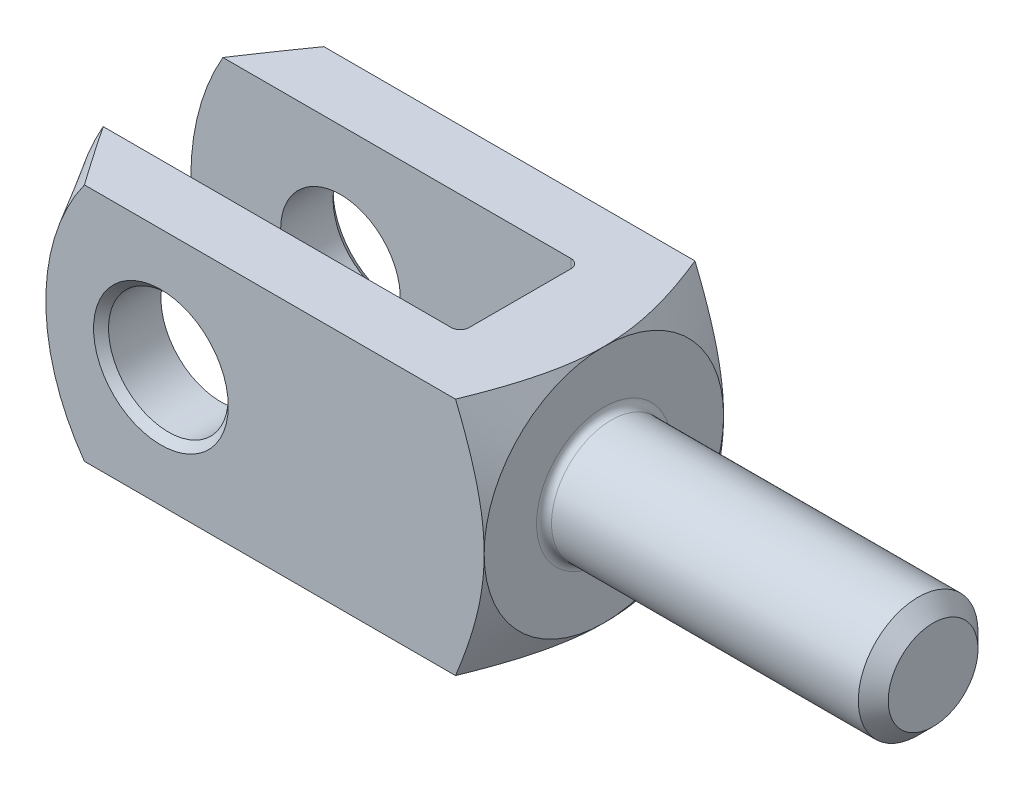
ISO-10303-21;
HEADER;
FILE_DESCRIPTION(('STEP AP214'),'2;1');
FILE_NAME('part.step','',(''),(''),'','','');
FILE_SCHEMA(('AUTOMOTIVE_DESIGN { 1 0 10303 214 1 1 1 1 }'));
ENDSEC;
DATA;
#1=APPLICATION_CONTEXT('core data for automotive mechanical design processes');
#2=APPLICATION_PROTOCOL_DEFINITION('international standard','automotive_design',2000,#1);
#3=PRODUCT_CONTEXT('',#1,'mechanical');
#4=PRODUCT('Part','Part','',(#3));
#5=PRODUCT_RELATED_PRODUCT_CATEGORY('part','',(#4));
#6=PRODUCT_DEFINITION_FORMATION('','',#4);
#7=PRODUCT_DEFINITION_CONTEXT('part definition',#1,'design');
#8=PRODUCT_DEFINITION('design','',#6,#7);
#9=PRODUCT_DEFINITION_SHAPE('','',#8);
#10=(LENGTH_UNIT() NAMED_UNIT(*) SI_UNIT(.MILLI.,.METRE.));
#11=(NAMED_UNIT(*) PLANE_ANGLE_UNIT() SI_UNIT($,.RADIAN.));
#12=(NAMED_UNIT(*) SI_UNIT($,.STERADIAN.) SOLID_ANGLE_UNIT());
#13=UNCERTAINTY_MEASURE_WITH_UNIT(LENGTH_MEASURE(1.E-05),#10,'distance_accuracy_value','');
#14=(GEOMETRIC_REPRESENTATION_CONTEXT(3) GLOBAL_UNCERTAINTY_ASSIGNED_CONTEXT((#13)) GLOBAL_UNIT_ASSIGNED_CONTEXT((#10,
#11,#12)) REPRESENTATION_CONTEXT('',''));
#15=CARTESIAN_POINT('',(0.,0.,0.));
#16=DIRECTION('',(0.,0.,1.));
#17=DIRECTION('',(1.,0.,0.));
#18=AXIS2_PLACEMENT_3D('',#15,#16,#17);
#19=CARTESIAN_POINT('',(-134.,-20.,-9.99999999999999));
#20=DIRECTION('',(0.,0.,-1.));
#21=DIRECTION('',(-1.,0.,0.));
#22=AXIS2_PLACEMENT_3D('',#19,#20,#21);
#23=PLANE('',#22);
#24=CARTESIAN_POINT('',(-109.,0.,-9.99999999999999));
#25=DIRECTION('',(0.,0.,-1.));
#26=DIRECTION('',(-1.,0.,0.));
#27=AXIS2_PLACEMENT_3D('',#24,#25,#26);
#28=CIRCLE('',#27,9.99999999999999);
#29=CARTESIAN_POINT('',(-119.,0.,-9.99999999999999));
#30=VERTEX_POINT('',#29);
#31=EDGE_CURVE('E160',#30,#30,#28,.F.);
#32=ORIENTED_EDGE('',*,*,#31,.F.);
#33=EDGE_LOOP('',(#32));
#34=FACE_BOUND('',#33,.T.);
#35=DIRECTION('',(-1.,0.,0.));
#36=VECTOR('',#35,1.);
#37=CARTESIAN_POINT('',(-134.,20.,-9.99999999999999));
#38=LINE('',#37,#36);
#39=CARTESIAN_POINT('',(-70.5,20.,-9.99999999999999));
#40=VERTEX_POINT('',#39);
#41=CARTESIAN_POINT('',(-128.641016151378,20.,-9.99999999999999));
#42=VERTEX_POINT('',#41);
#43=EDGE_CURVE('E321',#40,#42,#38,.T.);
#44=ORIENTED_EDGE('',*,*,#43,.T.);
#45=CARTESIAN_POINT('',(-94.,0.,-9.99999999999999));
#46=DIRECTION('',(0.,0.,1.));
#47=DIRECTION('',(1.,0.,0.));
#48=AXIS2_PLACEMENT_3D('',#45,#46,#47);
#49=CIRCLE('',#48,40.);
#50=CARTESIAN_POINT('',(-128.641016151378,-20.,-9.99999999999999));
#51=VERTEX_POINT('',#50);
#52=EDGE_CURVE('E61',#42,#51,#49,.T.);
#53=ORIENTED_EDGE('',*,*,#52,.T.);
#54=DIRECTION('',(-1.,0.,0.));
#55=VECTOR('',#54,1.);
#56=CARTESIAN_POINT('',(-134.,-20.,-9.99999999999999));
#57=LINE('',#56,#55);
#58=CARTESIAN_POINT('',(-70.5,-20.,-9.99999999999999));
#59=VERTEX_POINT('',#58);
#60=EDGE_CURVE('E311',#59,#51,#57,.T.);
#61=ORIENTED_EDGE('',*,*,#60,.F.);
#62=DIRECTION('',(0.,1.,0.));
#63=VECTOR('',#62,1.);
#64=CARTESIAN_POINT('',(-70.5,20.,-9.99999999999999));
#65=LINE('',#64,#63);
#66=EDGE_CURVE('E183',#59,#40,#65,.T.);
#67=ORIENTED_EDGE('',*,*,#66,.T.);
#68=EDGE_LOOP('',(#44,#53,#61,#67));
#69=FACE_BOUND('',#68,.T.);
#70=ADVANCED_FACE('F37',(#34,#69),#23,.F.);
#71=CARTESIAN_POINT('',(-134.,-20.,10.));
#72=DIRECTION('',(0.,0.,1.));
#73=DIRECTION('',(1.,0.,0.));
#74=AXIS2_PLACEMENT_3D('',#71,#72,#73);
#75=PLANE('',#74);
#76=CARTESIAN_POINT('',(-109.,0.,10.));
#77=DIRECTION('',(0.,0.,1.));
#78=DIRECTION('',(1.,0.,0.));
#79=AXIS2_PLACEMENT_3D('',#76,#77,#78);
#80=CIRCLE('',#79,9.99999999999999);
#81=CARTESIAN_POINT('',(-99.,0.,10.));
#82=VERTEX_POINT('',#81);
#83=EDGE_CURVE('E164',#82,#82,#80,.F.);
#84=ORIENTED_EDGE('',*,*,#83,.F.);
#85=EDGE_LOOP('',(#84));
#86=FACE_BOUND('',#85,.T.);
#87=CARTESIAN_POINT('',(-94.,0.,10.));
#88=DIRECTION('',(0.,0.,1.));
#89=DIRECTION('',(1.,0.,0.));
#90=AXIS2_PLACEMENT_3D('',#87,#88,#89);
#91=CIRCLE('',#90,40.);
#92=CARTESIAN_POINT('',(-128.641016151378,20.,10.));
#93=VERTEX_POINT('',#92);
#94=CARTESIAN_POINT('',(-128.641016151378,-20.,10.));
#95=VERTEX_POINT('',#94);
#96=EDGE_CURVE('E128',#93,#95,#91,.T.);
#97=ORIENTED_EDGE('',*,*,#96,.F.);
#98=DIRECTION('',(1.,0.,0.));
#99=VECTOR('',#98,1.);
#100=CARTESIAN_POINT('',(-134.,20.,10.));
#101=LINE('',#100,#99);
#102=CARTESIAN_POINT('',(-70.5,20.,10.));
#103=VERTEX_POINT('',#102);
#104=EDGE_CURVE('E325',#93,#103,#101,.T.);
#105=ORIENTED_EDGE('',*,*,#104,.T.);
#106=DIRECTION('',(0.,1.,0.));
#107=VECTOR('',#106,1.);
#108=CARTESIAN_POINT('',(-70.5,-20.,10.));
#109=LINE('',#108,#107);
#110=CARTESIAN_POINT('',(-70.5,-20.,10.));
#111=VERTEX_POINT('',#110);
#112=EDGE_CURVE('E179',#103,#111,#109,.F.);
#113=ORIENTED_EDGE('',*,*,#112,.T.);
#114=DIRECTION('',(1.,0.,0.));
#115=VECTOR('',#114,1.);
#116=CARTESIAN_POINT('',(-134.,-20.,10.));
#117=LINE('',#116,#115);
#118=EDGE_CURVE('E314',#95,#111,#117,.T.);
#119=ORIENTED_EDGE('',*,*,#118,.F.);
#120=EDGE_LOOP('',(#97,#105,#113,#119));
#121=FACE_BOUND('',#120,.T.);
#122=ADVANCED_FACE('F387',(#86,#121),#75,.F.);
#123=CARTESIAN_POINT('',(-134.,-20.,20.));
#124=DIRECTION('',(0.,0.,1.));
#125=DIRECTION('',(1.,0.,0.));
#126=AXIS2_PLACEMENT_3D('',#123,#124,#125);
#127=PLANE('',#126);
#128=CARTESIAN_POINT('',(-109.,0.,20.));
#129=DIRECTION('',(0.,0.,1.));
#130=DIRECTION('',(1.,0.,0.));
#131=AXIS2_PLACEMENT_3D('',#128,#129,#130);
#132=CIRCLE('',#131,11.25);
#133=CARTESIAN_POINT('',(-97.75,0.,20.));
#134=VERTEX_POINT('',#133);
#135=EDGE_CURVE('E219',#134,#134,#132,.F.);
#136=ORIENTED_EDGE('',*,*,#135,.T.);
#137=EDGE_LOOP('',(#136));
#138=FACE_BOUND('',#137,.T.);
#139=DIRECTION('',(1.,0.,0.));
#140=VECTOR('',#139,1.);
#141=CARTESIAN_POINT('',(-134.,20.,20.));
#142=LINE('',#141,#140);
#143=CARTESIAN_POINT('',(-121.775044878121,20.,20.));
#144=VERTEX_POINT('',#143);
#145=CARTESIAN_POINT('',(-59.7829262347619,20.,20.));
#146=VERTEX_POINT('',#145);
#147=EDGE_CURVE('E142',#144,#146,#142,.T.);
#148=ORIENTED_EDGE('',*,*,#147,.F.);
#149=CARTESIAN_POINT('',(-94.,0.,20.));
#150=DIRECTION('',(0.,0.,1.));
#151=DIRECTION('',(1.,0.,0.));
#152=AXIS2_PLACEMENT_3D('',#149,#150,#151);
#153=CIRCLE('',#152,34.2264973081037);
#154=CARTESIAN_POINT('',(-121.775044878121,-20.,20.));
#155=VERTEX_POINT('',#154);
#156=EDGE_CURVE('E53',#144,#155,#153,.T.);
#157=ORIENTED_EDGE('',*,*,#156,.T.);
#158=DIRECTION('',(1.,0.,0.));
#159=VECTOR('',#158,1.);
#160=CARTESIAN_POINT('',(-134.,-20.,20.));
#161=LINE('',#160,#159);
#162=CARTESIAN_POINT('',(-59.7829262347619,-20.,20.));
#163=VERTEX_POINT('',#162);
#164=EDGE_CURVE('E139',#155,#163,#161,.T.);
#165=ORIENTED_EDGE('',*,*,#164,.T.);
#166=CARTESIAN_POINT('',(-69.7117469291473,-40.8480870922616,20.));
#167=CARTESIAN_POINT('',(-69.4561917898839,-40.3552393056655,20.));
#168=CARTESIAN_POINT('',(-69.2013369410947,-39.8620284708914,20.));
#169=CARTESIAN_POINT('',(-68.693177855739,-38.874806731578,20.));
#170=CARTESIAN_POINT('',(-68.4398736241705,-38.3807958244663,20.));
#171=CARTESIAN_POINT('',(-67.6824888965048,-36.8974069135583,20.));
#172=CARTESIAN_POINT('',(-67.1809621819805,-35.9067224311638,20.));
#173=CARTESIAN_POINT('',(-66.18538005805,-33.9194417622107,20.));
#174=CARTESIAN_POINT('',(-65.6913391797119,-32.9228382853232,20.));
#175=CARTESIAN_POINT('',(-64.7136550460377,-30.9245603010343,20.));
#176=CARTESIAN_POINT('',(-64.2300116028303,-29.9228858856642,20.));
#177=CARTESIAN_POINT('',(-63.2464042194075,-27.8515018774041,20.));
#178=CARTESIAN_POINT('',(-62.7472668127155,-26.7813979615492,20.));
#179=CARTESIAN_POINT('',(-62.0128527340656,-25.1696896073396,20.));
#180=CARTESIAN_POINT('',(-61.7704219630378,-24.6313428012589,20.));
#181=CARTESIAN_POINT('',(-61.2910428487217,-23.5522150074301,20.));
#182=CARTESIAN_POINT('',(-61.0540944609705,-23.0114340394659,20.));
#183=CARTESIAN_POINT('',(-60.5865923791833,-21.9273871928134,20.));
#184=CARTESIAN_POINT('',(-60.356035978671,-21.3841224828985,20.));
#185=CARTESIAN_POINT('',(-59.9021820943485,-20.2945711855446,20.));
#186=CARTESIAN_POINT('',(-59.6788845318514,-19.748284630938,20.));
#187=CARTESIAN_POINT('',(-59.2407069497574,-18.6523948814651,20.));
#188=CARTESIAN_POINT('',(-59.0258261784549,-18.1027919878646,20.));
#189=CARTESIAN_POINT('',(-58.6058159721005,-16.999875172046,20.));
#190=CARTESIAN_POINT('',(-58.4006864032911,-16.4465613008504,20.));
#191=CARTESIAN_POINT('',(-57.9584948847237,-15.2154115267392,20.));
#192=CARTESIAN_POINT('',(-57.724154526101,-14.5365922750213,20.));
#193=CARTESIAN_POINT('',(-57.2756396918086,-13.1723527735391,20.));
#194=CARTESIAN_POINT('',(-57.061463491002,-12.4869330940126,20.));
#195=CARTESIAN_POINT('',(-56.6572524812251,-11.1089764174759,20.));
#196=CARTESIAN_POINT('',(-56.4672171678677,-10.4164395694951,20.));
#197=CARTESIAN_POINT('',(-56.115826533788,-9.02406913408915,20.));
#198=CARTESIAN_POINT('',(-55.9544708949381,-8.32423562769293,20.));
#199=CARTESIAN_POINT('',(-55.6686985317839,-6.93411418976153,20.));
#200=CARTESIAN_POINT('',(-55.543503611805,-6.24398781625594,20.));
#201=CARTESIAN_POINT('',(-55.329515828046,-4.85806653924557,20.));
#202=CARTESIAN_POINT('',(-55.2407217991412,-4.16227181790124,20.));
#203=CARTESIAN_POINT('',(-55.1032474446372,-2.76713808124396,20.));
#204=CARTESIAN_POINT('',(-55.0545409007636,-2.06780168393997,20.));
#205=CARTESIAN_POINT('',(-54.9993902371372,-0.667457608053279,20.));
#206=CARTESIAN_POINT('',(-54.9929446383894,0.0335500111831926,20.));
#207=CARTESIAN_POINT('',(-55.0215257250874,1.38358015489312,20.));
#208=CARTESIAN_POINT('',(-55.053564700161,2.03266864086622,20.));
#209=CARTESIAN_POINT('',(-55.1529107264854,3.32811214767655,20.));
#210=CARTESIAN_POINT('',(-55.2202176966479,3.97446717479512,20.));
#211=CARTESIAN_POINT('',(-55.3876322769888,5.26320613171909,20.));
#212=CARTESIAN_POINT('',(-55.4877568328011,5.90558783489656,20.));
#213=CARTESIAN_POINT('',(-55.7175054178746,7.18501977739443,20.));
#214=CARTESIAN_POINT('',(-55.8471302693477,7.82206986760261,20.));
#215=CARTESIAN_POINT('',(-56.1364002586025,9.10865741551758,20.));
#216=CARTESIAN_POINT('',(-56.2968057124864,9.75802261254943,20.));
#217=CARTESIAN_POINT('',(-56.6411635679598,11.0504361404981,20.));
#218=CARTESIAN_POINT('',(-56.8251161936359,11.6934844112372,20.));
#219=CARTESIAN_POINT('',(-57.2130089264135,12.9734650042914,20.));
#220=CARTESIAN_POINT('',(-57.4169481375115,13.6103975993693,20.));
#221=CARTESIAN_POINT('',(-57.7355110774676,14.561504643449,20.));
#222=CARTESIAN_POINT('',(-57.8438059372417,14.8778200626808,20.));
#223=CARTESIAN_POINT('',(-58.0642784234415,15.5090943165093,20.));
#224=CARTESIAN_POINT('',(-58.1764560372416,15.8240531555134,20.));
#225=CARTESIAN_POINT('',(-58.5368964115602,16.8182188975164,20.));
#226=CARTESIAN_POINT('',(-58.7917035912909,17.4950585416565,20.));
#227=CARTESIAN_POINT('',(-59.315152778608,18.8433829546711,20.));
#228=CARTESIAN_POINT('',(-59.5837956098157,19.5148674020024,20.));
#229=CARTESIAN_POINT('',(-60.1326821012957,20.8532445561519,20.));
#230=CARTESIAN_POINT('',(-60.412928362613,21.5201361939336,20.));
#231=CARTESIAN_POINT('',(-60.9830913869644,22.8497479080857,20.));
#232=CARTESIAN_POINT('',(-61.2730079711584,23.5124680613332,20.));
#233=CARTESIAN_POINT('',(-61.86125118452,24.8348444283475,20.));
#234=CARTESIAN_POINT('',(-62.1595848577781,25.4944975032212,20.));
#235=CARTESIAN_POINT('',(-62.7631804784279,26.8106245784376,20.));
#236=CARTESIAN_POINT('',(-63.0684424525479,27.467098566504,20.));
#237=CARTESIAN_POINT('',(-63.6848375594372,28.7771877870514,20.));
#238=CARTESIAN_POINT('',(-63.9959700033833,29.4308033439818,20.));
#239=CARTESIAN_POINT('',(-64.6233091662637,30.7355965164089,20.));
#240=CARTESIAN_POINT('',(-64.9395159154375,31.3867741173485,20.));
#241=CARTESIAN_POINT('',(-65.896609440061,33.3410563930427,20.));
#242=CARTESIAN_POINT('',(-66.5440877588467,34.6409339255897,20.));
#243=CARTESIAN_POINT('',(-67.8522843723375,37.2340227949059,20.));
#244=CARTESIAN_POINT('',(-68.5130029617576,38.5272339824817,20.));
#245=CARTESIAN_POINT('',(-69.8443480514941,41.1077325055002,20.));
#246=CARTESIAN_POINT('',(-70.5149695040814,42.3950224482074,20.));
#247=CARTESIAN_POINT('',(-71.8642487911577,44.9653657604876,20.));
#248=CARTESIAN_POINT('',(-72.5429065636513,46.2484191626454,20.));
#249=CARTESIAN_POINT('',(-73.8053932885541,48.6208089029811,20.));
#250=CARTESIAN_POINT('',(-74.3883375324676,49.7106165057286,20.));
#251=CARTESIAN_POINT('',(-75.5581313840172,51.8881346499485,20.));
#252=CARTESIAN_POINT('',(-76.1449809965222,52.9758451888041,20.));
#253=CARTESIAN_POINT('',(-77.3220562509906,55.1496344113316,20.));
#254=CARTESIAN_POINT('',(-77.9122823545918,56.2357128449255,20.));
#255=CARTESIAN_POINT('',(-79.0955388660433,58.4063411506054,20.));
#256=CARTESIAN_POINT('',(-79.6885692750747,59.4908910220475,20.));
#257=CARTESIAN_POINT('',(-80.8736310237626,61.6524632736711,20.));
#258=CARTESIAN_POINT('',(-81.465648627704,62.7294931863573,20.));
#259=CARTESIAN_POINT('',(-82.6517398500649,64.8824205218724,20.));
#260=CARTESIAN_POINT('',(-83.2458134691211,65.9583179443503,20.));
#261=CARTESIAN_POINT('',(-84.4356534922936,68.108954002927,20.));
#262=CARTESIAN_POINT('',(-85.0314196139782,69.1836927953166,20.));
#263=CARTESIAN_POINT('',(-86.2245219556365,71.332296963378,20.));
#264=CARTESIAN_POINT('',(-86.8218581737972,72.4061623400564,20.));
#265=CARTESIAN_POINT('',(-87.4198720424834,73.4796497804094,20.));
#266=B_SPLINE_CURVE_WITH_KNOTS('',3,(#166,#167,#168,#169,#170,#171,#172,#173,#174,#175,#176,
#177,#178,#179,#180,#181,#182,#183,#184,#185,#186,#187,#188,#189,#190,#191,#192,#193,#194,#195,
#196,#197,#198,#199,#200,#201,#202,#203,#204,#205,#206,#207,#208,#209,#210,#211,#212,#213,#214,
#215,#216,#217,#218,#219,#220,#221,#222,#223,#224,#225,#226,#227,#228,#229,#230,#231,#232,#233,
#234,#235,#236,#237,#238,#239,#240,#241,#242,#243,#244,#245,#246,#247,#248,#249,#250,#251,#252,
#253,#254,#255,#256,#257,#258,#259,#260,#261,#262,#263,#264,#265),.UNSPECIFIED.,.F.,.F.,(4,2,2,
2,2,2,2,2,2,2,2,2,2,2,2,2,2,2,2,2,2,2,2,2,2,2,2,2,2,2,2,2,2,2,2,2,2,2,2,2,2,2,2,2,2,2,2,2,2,4),
(0.,1.66549183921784,3.3309890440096,6.66215149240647,9.9991147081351,13.3360175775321,
16.8782159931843,18.6494369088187,20.4206434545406,22.1910882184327,23.961513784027,
25.7317808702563,27.5020236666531,29.6561476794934,31.8100872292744,33.9639817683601,
36.117852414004,38.2211628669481,40.3244059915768,42.4262724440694,44.5280653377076,
46.4767082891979,48.4253467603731,50.3749930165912,52.324693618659,54.3308265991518,
56.3369786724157,58.3430408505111,59.346040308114,60.3490365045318,62.5184742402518,
64.6880412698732,66.8580972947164,69.0281132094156,71.2000024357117,73.3719000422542,
75.5435443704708,77.7152016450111,82.0717130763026,86.4283215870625,90.7827812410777,
95.1372073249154,98.8449661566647,102.552729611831,106.261012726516,109.969297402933,
113.656340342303,117.343384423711,121.02984567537,124.716302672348),.UNSPECIFIED.);
#267=CARTESIAN_POINT('',(-55.,0.,20.));
#268=VERTEX_POINT('',#267);
#269=EDGE_CURVE('E283',#268,#163,#266,.F.);
#270=ORIENTED_EDGE('',*,*,#269,.F.);
#271=EDGE_CURVE('E281',#146,#268,#266,.F.);
#272=ORIENTED_EDGE('',*,*,#271,.F.);
#273=EDGE_LOOP('',(#148,#157,#165,#270,#272));
#274=FACE_BOUND('',#273,.T.);
#275=ADVANCED_FACE('F137',(#138,#274),#127,.T.);
#276=CARTESIAN_POINT('',(-134.,-20.,20.));
#277=DIRECTION('',(0.,-1.,0.));
#278=DIRECTION('',(0.,0.,-1.));
#279=AXIS2_PLACEMENT_3D('',#276,#277,#278);
#280=PLANE('',#279);
#281=ORIENTED_EDGE('',*,*,#60,.T.);
#282=CARTESIAN_POINT('',(-144.464255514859,-20.,14.7388337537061));
#283=CARTESIAN_POINT('',(-143.977726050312,-20.,13.9554262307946));
#284=CARTESIAN_POINT('',(-143.490511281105,-20.,13.1724443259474));
#285=CARTESIAN_POINT('',(-142.514581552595,-20.,11.6074156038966));
#286=CARTESIAN_POINT('',(-142.025866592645,-20.,10.8253687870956));
#287=CARTESIAN_POINT('',(-140.557258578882,-20.,8.48072725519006));
#288=CARTESIAN_POINT('',(-139.574921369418,-20.,6.91966204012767));
#289=CARTESIAN_POINT('',(-137.601276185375,-20.,3.80059817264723));
#290=CARTESIAN_POINT('',(-136.609958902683,-20.,2.24260540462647));
#291=CARTESIAN_POINT('',(-135.115876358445,-20.,-0.0898192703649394));
#292=CARTESIAN_POINT('',(-134.616667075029,-20.,-0.866529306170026));
#293=CARTESIAN_POINT('',(-133.615610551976,-20.,-2.41825426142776));
#294=CARTESIAN_POINT('',(-133.113763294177,-20.,-3.19326916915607));
#295=CARTESIAN_POINT('',(-131.561953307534,-20.,-5.57992347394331));
#296=CARTESIAN_POINT('',(-130.50712682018,-20.,-7.18841108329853));
#297=CARTESIAN_POINT('',(-128.912924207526,-20.,-9.5931998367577));
#298=CARTESIAN_POINT('',(-128.379531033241,-20.,-10.3934700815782));
#299=CARTESIAN_POINT('',(-127.308209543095,-20.,-11.9909680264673));
#300=CARTESIAN_POINT('',(-126.770281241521,-20.,-12.7881957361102));
#301=CARTESIAN_POINT('',(-125.689661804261,-20.,-14.378560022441));
#302=CARTESIAN_POINT('',(-125.146974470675,-20.,-15.1716991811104));
#303=CARTESIAN_POINT('',(-124.055691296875,-20.,-16.7539080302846));
#304=CARTESIAN_POINT('',(-123.507095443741,-20.,-17.5429777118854));
#305=CARTESIAN_POINT('',(-122.403112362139,-20.,-19.1163023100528));
#306=CARTESIAN_POINT('',(-121.847725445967,-20.,-19.90055744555));
#307=CARTESIAN_POINT('',(-120.729030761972,-20.,-21.4633921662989));
#308=CARTESIAN_POINT('',(-120.165723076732,-20.,-22.2419718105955));
#309=CARTESIAN_POINT('',(-119.035102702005,-20.,-23.7851048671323));
#310=CARTESIAN_POINT('',(-118.467876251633,-20.,-24.5497213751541));
#311=CARTESIAN_POINT('',(-117.322623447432,-20.,-26.0708599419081));
#312=CARTESIAN_POINT('',(-116.744596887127,-20.,-26.8273818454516));
#313=CARTESIAN_POINT('',(-115.574851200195,-20.,-28.3314583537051));
#314=CARTESIAN_POINT('',(-114.983114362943,-20.,-29.0789992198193));
#315=CARTESIAN_POINT('',(-113.784049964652,-20.,-30.561432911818));
#316=CARTESIAN_POINT('',(-113.176723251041,-20.,-31.2963264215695));
#317=CARTESIAN_POINT('',(-111.949334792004,-20.,-32.7424372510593));
#318=CARTESIAN_POINT('',(-111.329470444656,-20.,-33.4538210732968));
#319=CARTESIAN_POINT('',(-110.382190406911,-20.,-34.5053301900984));
#320=CARTESIAN_POINT('',(-110.063464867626,-20.,-34.8532924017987));
#321=CARTESIAN_POINT('',(-109.419506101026,-20.,-35.5431342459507));
#322=CARTESIAN_POINT('',(-109.094273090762,-20.,-35.8850140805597));
#323=CARTESIAN_POINT('',(-108.437235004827,-20.,-36.560934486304));
#324=CARTESIAN_POINT('',(-108.105446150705,-20.,-36.8949907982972));
#325=CARTESIAN_POINT('',(-107.43367259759,-20.,-37.5548111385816));
#326=CARTESIAN_POINT('',(-107.093687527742,-20.,-37.8805747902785));
#327=CARTESIAN_POINT('',(-106.404695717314,-20.,-38.5220472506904));
#328=CARTESIAN_POINT('',(-106.055694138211,-20.,-38.8377615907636));
#329=CARTESIAN_POINT('',(-105.347353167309,-20.,-39.4573309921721));
#330=CARTESIAN_POINT('',(-104.988015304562,-20.,-39.7611877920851));
#331=CARTESIAN_POINT('',(-104.433764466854,-20.,-40.2114960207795));
#332=CARTESIAN_POINT('',(-104.243111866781,-20.,-40.3632010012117));
#333=CARTESIAN_POINT('',(-103.858487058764,-20.,-40.66233874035));
#334=CARTESIAN_POINT('',(-103.664514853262,-20.,-40.8097715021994));
#335=CARTESIAN_POINT('',(-103.077241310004,-20.,-41.2450393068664));
#336=CARTESIAN_POINT('',(-102.678634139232,-20.,-41.5258020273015));
#337=CARTESIAN_POINT('',(-101.866141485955,-20.,-42.0636748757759));
#338=CARTESIAN_POINT('',(-101.452268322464,-20.,-42.3208035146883));
#339=CARTESIAN_POINT('',(-100.607700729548,-20.,-42.8058851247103));
#340=CARTESIAN_POINT('',(-100.17701073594,-20.,-43.0338457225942));
#341=CARTESIAN_POINT('',(-99.3985594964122,-20.,-43.405649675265));
#342=CARTESIAN_POINT('',(-99.0543057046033,-20.,-43.5568168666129));
#343=CARTESIAN_POINT('',(-98.3557183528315,-20.,-43.8338983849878));
#344=CARTESIAN_POINT('',(-98.0013856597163,-20.,-43.9598148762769));
#345=CARTESIAN_POINT('',(-97.2841094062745,-20.,-44.1824113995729));
#346=CARTESIAN_POINT('',(-96.9211785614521,-20.,-44.2791320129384));
#347=CARTESIAN_POINT('',(-96.1881060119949,-20.,-44.4400017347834));
#348=CARTESIAN_POINT('',(-95.8179646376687,-20.,-44.5041523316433));
#349=CARTESIAN_POINT('',(-95.0694904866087,-20.,-44.5976048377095));
#350=CARTESIAN_POINT('',(-94.6911128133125,-20.,-44.6265519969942));
#351=CARTESIAN_POINT('',(-93.9333496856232,-20.,-44.6470380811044));
#352=CARTESIAN_POINT('',(-93.5539642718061,-20.,-44.6385784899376));
#353=CARTESIAN_POINT('',(-92.7977863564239,-20.,-44.5846599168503));
#354=CARTESIAN_POINT('',(-92.420994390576,-20.,-44.5391935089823));
#355=CARTESIAN_POINT('',(-91.6733097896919,-20.,-44.4133535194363));
#356=CARTESIAN_POINT('',(-91.3024180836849,-20.,-44.3329744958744));
#357=CARTESIAN_POINT('',(-90.5010820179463,-20.,-44.1227716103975));
#358=CARTESIAN_POINT('',(-90.0723250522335,-20.,-43.9865486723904));
#359=CARTESIAN_POINT('',(-89.2287155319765,-20.,-43.6760654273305));
#360=CARTESIAN_POINT('',(-88.8138708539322,-20.,-43.5017839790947));
#361=CARTESIAN_POINT('',(-88.2021903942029,-20.,-43.2164310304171));
#362=CARTESIAN_POINT('',(-87.9997370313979,-20.,-43.1171417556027));
#363=CARTESIAN_POINT('',(-87.5986091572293,-20.,-42.9113932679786));
#364=CARTESIAN_POINT('',(-87.3999330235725,-20.,-42.8049372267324));
#365=CARTESIAN_POINT('',(-87.00622455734,-20.,-42.5855142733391));
#366=CARTESIAN_POINT('',(-86.8111921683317,-20.,-42.4725474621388));
#367=CARTESIAN_POINT('',(-86.4246406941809,-20.,-42.2407087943));
#368=CARTESIAN_POINT('',(-86.2331221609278,-20.,-42.1218360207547));
#369=CARTESIAN_POINT('',(-85.5392426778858,-20.,-41.6775875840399));
#370=CARTESIAN_POINT('',(-85.0471261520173,-20.,-41.3361114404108));
#371=CARTESIAN_POINT('',(-84.0840622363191,-20.,-40.6244535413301));
#372=CARTESIAN_POINT('',(-83.6131250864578,-20.,-40.2542581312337));
#373=CARTESIAN_POINT('',(-82.6888042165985,-20.,-39.4909076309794));
#374=CARTESIAN_POINT('',(-82.2354560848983,-20.,-39.0977096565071));
#375=CARTESIAN_POINT('',(-81.3447584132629,-20.,-38.2938363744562));
#376=CARTESIAN_POINT('',(-80.9074062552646,-20.,-37.8831639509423));
#377=CARTESIAN_POINT('',(-80.0434779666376,-20.,-37.0449994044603));
#378=CARTESIAN_POINT('',(-79.6169935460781,-20.,-36.6174131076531));
#379=CARTESIAN_POINT('',(-78.7759134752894,-20.,-35.7507127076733));
#380=CARTESIAN_POINT('',(-78.3613182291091,-20.,-35.3115982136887));
#381=CARTESIAN_POINT('',(-77.5428320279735,-20.,-34.42436998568));
#382=CARTESIAN_POINT('',(-77.1389304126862,-20.,-33.9762660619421));
#383=CARTESIAN_POINT('',(-76.3400472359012,-20.,-33.0722099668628));
#384=CARTESIAN_POINT('',(-75.9450655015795,-20.,-32.6162579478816));
#385=CARTESIAN_POINT('',(-75.0007892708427,-20.,-31.5074230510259));
#386=CARTESIAN_POINT('',(-74.4553790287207,-20.,-30.851233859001));
#387=CARTESIAN_POINT('',(-73.3773944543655,-20.,-29.5282176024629));
#388=CARTESIAN_POINT('',(-72.8448226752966,-20.,-28.8613884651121));
#389=CARTESIAN_POINT('',(-71.798651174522,-20.,-27.529465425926));
#390=CARTESIAN_POINT('',(-71.2848857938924,-20.,-26.8645014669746));
#391=CARTESIAN_POINT('',(-70.5210718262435,-20.,-25.8620207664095));
#392=CARTESIAN_POINT('',(-70.2676429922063,-20.,-25.5270710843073));
#393=CARTESIAN_POINT('',(-69.7628770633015,-20.,-24.8556040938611));
#394=CARTESIAN_POINT('',(-69.5115399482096,-20.,-24.519086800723));
#395=CARTESIAN_POINT('',(-69.2611662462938,-20.,-24.1818536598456));
#396=B_SPLINE_CURVE_WITH_KNOTS('',3,(#282,#283,#284,#285,#286,#287,#288,#289,#290,#291,#292,
#293,#294,#295,#296,#297,#298,#299,#300,#301,#302,#303,#304,#305,#306,#307,#308,#309,#310,#311,
#312,#313,#314,#315,#316,#317,#318,#319,#320,#321,#322,#323,#324,#325,#326,#327,#328,#329,#330,
#331,#332,#333,#334,#335,#336,#337,#338,#339,#340,#341,#342,#343,#344,#345,#346,#347,#348,#349,
#350,#351,#352,#353,#354,#355,#356,#357,#358,#359,#360,#361,#362,#363,#364,#365,#366,#367,#368,
#369,#370,#371,#372,#373,#374,#375,#376,#377,#378,#379,#380,#381,#382,#383,#384,#385,#386,#387,
#388,#389,#390,#391,#392,#393,#394,#395),.UNSPECIFIED.,.F.,.F.,(4,2,2,2,2,2,2,2,2,2,2,2,2,2,2,2,
2,2,2,2,2,2,2,2,2,2,2,2,2,2,2,2,2,2,2,2,2,2,2,2,2,2,2,2,2,2,2,2,2,2,2,2,2,2,2,2,4),(0.,
2.76657575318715,5.5331526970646,11.0664145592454,16.6062810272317,19.3761848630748,
22.1461077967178,27.9165467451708,30.8017500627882,33.6869442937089,36.5700122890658,
39.4530865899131,42.3360288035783,45.2189409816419,48.0749879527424,50.9310895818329,
53.7911127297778,56.6509807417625,59.4811890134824,60.8967393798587,62.3122426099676,
63.7245983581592,65.1370181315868,66.5486465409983,67.9600671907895,68.6909476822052,
69.4218276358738,70.8837854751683,72.3445883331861,73.805008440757,74.9321155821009,
76.0591260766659,77.184562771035,78.3099480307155,79.4465824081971,80.5831716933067,
81.7199891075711,82.8569837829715,84.204481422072,85.5527294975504,86.2290826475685,
86.9051384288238,87.5811837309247,88.2573343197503,90.0527538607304,91.8490323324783,
93.6487735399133,95.4482188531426,97.2597072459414,99.0712571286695,100.880927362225,
102.690562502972,105.250134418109,107.810211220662,110.331064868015,111.591120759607,
112.851164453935),.UNSPECIFIED.);
#397=CARTESIAN_POINT('',(-121.775044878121,-20.,-20.));
#398=VERTEX_POINT('',#397);
#399=EDGE_CURVE('E133',#51,#398,#396,.T.);
#400=ORIENTED_EDGE('',*,*,#399,.T.);
#401=DIRECTION('',(1.,0.,0.));
#402=VECTOR('',#401,1.);
#403=CARTESIAN_POINT('',(-134.,-20.,-20.));
#404=LINE('',#403,#402);
#405=CARTESIAN_POINT('',(-59.7829262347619,-20.,-20.));
#406=VERTEX_POINT('',#405);
#407=EDGE_CURVE('E152',#398,#406,#404,.T.);
#408=ORIENTED_EDGE('',*,*,#407,.T.);
#409=CARTESIAN_POINT('',(-69.7117469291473,-20.,-40.8480870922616));
#410=CARTESIAN_POINT('',(-69.4561917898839,-20.,-40.3552393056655));
#411=CARTESIAN_POINT('',(-69.2013369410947,-20.,-39.8620284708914));
#412=CARTESIAN_POINT('',(-68.693177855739,-20.,-38.874806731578));
#413=CARTESIAN_POINT('',(-68.4398736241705,-20.,-38.3807958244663));
#414=CARTESIAN_POINT('',(-67.6824888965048,-20.,-36.8974069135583));
#415=CARTESIAN_POINT('',(-67.1809621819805,-20.,-35.9067224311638));
#416=CARTESIAN_POINT('',(-66.18538005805,-20.,-33.9194417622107));
#417=CARTESIAN_POINT('',(-65.6913391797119,-20.,-32.9228382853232));
#418=CARTESIAN_POINT('',(-64.7136550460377,-20.,-30.9245603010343));
#419=CARTESIAN_POINT('',(-64.2300116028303,-20.,-29.9228858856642));
#420=CARTESIAN_POINT('',(-63.2464042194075,-20.,-27.8515018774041));
#421=CARTESIAN_POINT('',(-62.7472668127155,-20.,-26.7813979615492));
#422=CARTESIAN_POINT('',(-62.0128527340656,-20.,-25.1696896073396));
#423=CARTESIAN_POINT('',(-61.7704219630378,-20.,-24.6313428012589));
#424=CARTESIAN_POINT('',(-61.2910428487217,-20.,-23.5522150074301));
#425=CARTESIAN_POINT('',(-61.0540944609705,-20.,-23.0114340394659));
#426=CARTESIAN_POINT('',(-60.5865923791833,-20.,-21.9273871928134));
#427=CARTESIAN_POINT('',(-60.356035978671,-20.,-21.3841224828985));
#428=CARTESIAN_POINT('',(-59.9021820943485,-20.,-20.2945711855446));
#429=CARTESIAN_POINT('',(-59.6788845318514,-20.,-19.748284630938));
#430=CARTESIAN_POINT('',(-59.2407069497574,-20.,-18.6523948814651));
#431=CARTESIAN_POINT('',(-59.0258261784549,-20.,-18.1027919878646));
#432=CARTESIAN_POINT('',(-58.6058159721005,-20.,-16.999875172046));
#433=CARTESIAN_POINT('',(-58.4006864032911,-20.,-16.4465613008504));
#434=CARTESIAN_POINT('',(-57.9584948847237,-20.,-15.2154115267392));
#435=CARTESIAN_POINT('',(-57.724154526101,-20.,-14.5365922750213));
#436=CARTESIAN_POINT('',(-57.2756396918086,-20.,-13.1723527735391));
#437=CARTESIAN_POINT('',(-57.061463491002,-20.,-12.4869330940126));
#438=CARTESIAN_POINT('',(-56.6572524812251,-20.,-11.1089764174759));
#439=CARTESIAN_POINT('',(-56.4672171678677,-20.,-10.4164395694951));
#440=CARTESIAN_POINT('',(-56.115826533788,-20.,-9.02406913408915));
#441=CARTESIAN_POINT('',(-55.9544708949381,-20.,-8.32423562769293));
#442=CARTESIAN_POINT('',(-55.6686985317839,-20.,-6.93411418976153));
#443=CARTESIAN_POINT('',(-55.543503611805,-20.,-6.24398781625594));
#444=CARTESIAN_POINT('',(-55.329515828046,-20.,-4.85806653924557));
#445=CARTESIAN_POINT('',(-55.2407217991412,-20.,-4.16227181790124));
#446=CARTESIAN_POINT('',(-55.1032474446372,-20.,-2.76713808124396));
#447=CARTESIAN_POINT('',(-55.0545409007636,-20.,-2.06780168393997));
#448=CARTESIAN_POINT('',(-54.9993902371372,-20.,-0.667457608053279));
#449=CARTESIAN_POINT('',(-54.9929446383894,-20.,0.0335500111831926));
#450=CARTESIAN_POINT('',(-55.0215257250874,-20.,1.38358015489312));
#451=CARTESIAN_POINT('',(-55.053564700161,-20.,2.03266864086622));
#452=CARTESIAN_POINT('',(-55.1529107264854,-20.,3.32811214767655));
#453=CARTESIAN_POINT('',(-55.2202176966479,-20.,3.97446717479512));
#454=CARTESIAN_POINT('',(-55.3876322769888,-20.,5.26320613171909));
#455=CARTESIAN_POINT('',(-55.4877568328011,-20.,5.90558783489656));
#456=CARTESIAN_POINT('',(-55.7175054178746,-20.,7.18501977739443));
#457=CARTESIAN_POINT('',(-55.8471302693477,-20.,7.82206986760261));
#458=CARTESIAN_POINT('',(-56.1364002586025,-20.,9.10865741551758));
#459=CARTESIAN_POINT('',(-56.2968057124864,-20.,9.75802261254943));
#460=CARTESIAN_POINT('',(-56.6411635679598,-20.,11.0504361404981));
#461=CARTESIAN_POINT('',(-56.8251161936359,-20.,11.6934844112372));
#462=CARTESIAN_POINT('',(-57.2130089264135,-20.,12.9734650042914));
#463=CARTESIAN_POINT('',(-57.4169481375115,-20.,13.6103975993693));
#464=CARTESIAN_POINT('',(-57.7355110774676,-20.,14.561504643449));
#465=CARTESIAN_POINT('',(-57.8438059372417,-20.,14.8778200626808));
#466=CARTESIAN_POINT('',(-58.0642784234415,-20.,15.5090943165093));
#467=CARTESIAN_POINT('',(-58.1764560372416,-20.,15.8240531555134));
#468=CARTESIAN_POINT('',(-58.5368964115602,-20.,16.8182188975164));
#469=CARTESIAN_POINT('',(-58.7917035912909,-20.,17.4950585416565));
#470=CARTESIAN_POINT('',(-59.315152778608,-20.,18.8433829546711));
#471=CARTESIAN_POINT('',(-59.5837956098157,-20.,19.5148674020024));
#472=CARTESIAN_POINT('',(-60.1326821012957,-20.,20.8532445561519));
#473=CARTESIAN_POINT('',(-60.412928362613,-20.,21.5201361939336));
#474=CARTESIAN_POINT('',(-60.9830913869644,-20.,22.8497479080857));
#475=CARTESIAN_POINT('',(-61.2730079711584,-20.,23.5124680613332));
#476=CARTESIAN_POINT('',(-61.86125118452,-20.,24.8348444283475));
#477=CARTESIAN_POINT('',(-62.1595848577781,-20.,25.4944975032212));
#478=CARTESIAN_POINT('',(-62.7631804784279,-20.,26.8106245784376));
#479=CARTESIAN_POINT('',(-63.0684424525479,-20.,27.467098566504));
#480=CARTESIAN_POINT('',(-63.6848375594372,-20.,28.7771877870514));
#481=CARTESIAN_POINT('',(-63.9959700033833,-20.,29.4308033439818));
#482=CARTESIAN_POINT('',(-64.6233091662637,-20.,30.7355965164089));
#483=CARTESIAN_POINT('',(-64.9395159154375,-20.,31.3867741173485));
#484=CARTESIAN_POINT('',(-65.896609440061,-20.,33.3410563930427));
#485=CARTESIAN_POINT('',(-66.5440877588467,-20.,34.6409339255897));
#486=CARTESIAN_POINT('',(-67.8522843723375,-20.,37.2340227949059));
#487=CARTESIAN_POINT('',(-68.5130029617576,-20.,38.5272339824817));
#488=CARTESIAN_POINT('',(-69.8443480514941,-20.,41.1077325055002));
#489=CARTESIAN_POINT('',(-70.5149695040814,-20.,42.3950224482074));
#490=CARTESIAN_POINT('',(-71.8642487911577,-20.,44.9653657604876));
#491=CARTESIAN_POINT('',(-72.5429065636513,-20.,46.2484191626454));
#492=CARTESIAN_POINT('',(-73.8053932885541,-20.,48.6208089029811));
#493=CARTESIAN_POINT('',(-74.3883375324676,-20.,49.7106165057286));
#494=CARTESIAN_POINT('',(-75.5581313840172,-20.,51.8881346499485));
#495=CARTESIAN_POINT('',(-76.1449809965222,-20.,52.9758451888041));
#496=CARTESIAN_POINT('',(-77.3220562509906,-20.,55.1496344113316));
#497=CARTESIAN_POINT('',(-77.9122823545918,-20.,56.2357128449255));
#498=CARTESIAN_POINT('',(-79.0955388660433,-20.,58.4063411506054));
#499=CARTESIAN_POINT('',(-79.6885692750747,-20.,59.4908910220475));
#500=CARTESIAN_POINT('',(-80.8736310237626,-20.,61.6524632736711));
#501=CARTESIAN_POINT('',(-81.465648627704,-20.,62.7294931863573));
#502=CARTESIAN_POINT('',(-82.6517398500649,-20.,64.8824205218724));
#503=CARTESIAN_POINT('',(-83.2458134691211,-20.,65.9583179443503));
#504=CARTESIAN_POINT('',(-84.4356534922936,-20.,68.108954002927));
#505=CARTESIAN_POINT('',(-85.0314196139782,-20.,69.1836927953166));
#506=CARTESIAN_POINT('',(-86.2245219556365,-20.,71.332296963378));
#507=CARTESIAN_POINT('',(-86.8218581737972,-20.,72.4061623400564));
#508=CARTESIAN_POINT('',(-87.4198720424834,-20.,73.4796497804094));
#509=B_SPLINE_CURVE_WITH_KNOTS('',3,(#409,#410,#411,#412,#413,#414,#415,#416,#417,#418,#419,
#420,#421,#422,#423,#424,#425,#426,#427,#428,#429,#430,#431,#432,#433,#434,#435,#436,#437,#438,
#439,#440,#441,#442,#443,#444,#445,#446,#447,#448,#449,#450,#451,#452,#453,#454,#455,#456,#457,
#458,#459,#460,#461,#462,#463,#464,#465,#466,#467,#468,#469,#470,#471,#472,#473,#474,#475,#476,
#477,#478,#479,#480,#481,#482,#483,#484,#485,#486,#487,#488,#489,#490,#491,#492,#493,#494,#495,
#496,#497,#498,#499,#500,#501,#502,#503,#504,#505,#506,#507,#508),.UNSPECIFIED.,.F.,.F.,(4,2,2,
2,2,2,2,2,2,2,2,2,2,2,2,2,2,2,2,2,2,2,2,2,2,2,2,2,2,2,2,2,2,2,2,2,2,2,2,2,2,2,2,2,2,2,2,2,2,4),
(0.,1.66549183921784,3.3309890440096,6.66215149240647,9.9991147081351,13.3360175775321,
16.8782159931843,18.6494369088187,20.4206434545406,22.1910882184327,23.961513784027,
25.7317808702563,27.5020236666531,29.6561476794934,31.8100872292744,33.9639817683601,
36.117852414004,38.2211628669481,40.3244059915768,42.4262724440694,44.5280653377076,
46.4767082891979,48.4253467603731,50.3749930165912,52.324693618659,54.3308265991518,
56.3369786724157,58.3430408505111,59.346040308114,60.3490365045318,62.5184742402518,
64.6880412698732,66.8580972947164,69.0281132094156,71.2000024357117,73.3719000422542,
75.5435443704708,77.7152016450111,82.0717130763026,86.4283215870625,90.7827812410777,
95.1372073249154,98.8449661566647,102.552729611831,106.261012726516,109.969297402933,
113.656340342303,117.343384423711,121.02984567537,124.716302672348),.UNSPECIFIED.);
#510=CARTESIAN_POINT('',(-55.,-20.,0.));
#511=VERTEX_POINT('',#510);
#512=EDGE_CURVE('E282',#511,#406,#509,.F.);
#513=ORIENTED_EDGE('',*,*,#512,.F.);
#514=EDGE_CURVE('E150',#163,#511,#509,.F.);
#515=ORIENTED_EDGE('',*,*,#514,.F.);
#516=ORIENTED_EDGE('',*,*,#164,.F.);
#517=CARTESIAN_POINT('',(-69.2611662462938,-20.,24.1818536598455));
#518=CARTESIAN_POINT('',(-69.6679626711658,-20.,24.7297299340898));
#519=CARTESIAN_POINT('',(-70.077273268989,-20.,25.2757537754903));
#520=CARTESIAN_POINT('',(-70.9017157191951,-20.,26.3634473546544));
#521=CARTESIAN_POINT('',(-71.3168479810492,-20.,26.9051167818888));
#522=CARTESIAN_POINT('',(-72.1544116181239,-20.,27.9843310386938));
#523=CARTESIAN_POINT('',(-72.5768546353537,-20.,28.5218668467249));
#524=CARTESIAN_POINT('',(-73.4292654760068,-20.,29.5909267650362));
#525=CARTESIAN_POINT('',(-73.8592331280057,-20.,30.1224510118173));
#526=CARTESIAN_POINT('',(-74.7321155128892,-20.,31.1835785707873));
#527=CARTESIAN_POINT('',(-75.1751160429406,-20.,31.7131114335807));
#528=CARTESIAN_POINT('',(-76.0713675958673,-20.,32.7634253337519));
#529=CARTESIAN_POINT('',(-76.5246183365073,-20.,33.2842066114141));
#530=CARTESIAN_POINT('',(-77.4428116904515,-20.,34.3147687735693));
#531=CARTESIAN_POINT('',(-77.9077463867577,-20.,34.8245566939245));
#532=CARTESIAN_POINT('',(-78.851671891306,-20.,35.8309085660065));
#533=CARTESIAN_POINT('',(-79.3306612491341,-20.,36.3274738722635));
#534=CARTESIAN_POINT('',(-80.2284140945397,-20.,37.2269049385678));
#535=CARTESIAN_POINT('',(-80.6447495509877,-20.,37.6321885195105));
#536=CARTESIAN_POINT('',(-81.4911966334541,-20.,38.428252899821));
#537=CARTESIAN_POINT('',(-81.921309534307,-20.,38.8190323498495));
#538=CARTESIAN_POINT('',(-82.7977080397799,-20.,39.5826194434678));
#539=CARTESIAN_POINT('',(-83.2440026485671,-20.,39.9554168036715));
#540=CARTESIAN_POINT('',(-84.1549971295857,-20.,40.6778860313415));
#541=CARTESIAN_POINT('',(-84.6196947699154,-20.,41.0275606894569));
#542=CARTESIAN_POINT('',(-85.5032665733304,-20.,41.6500477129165));
#543=CARTESIAN_POINT('',(-85.9193848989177,-20.,41.9267513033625));
#544=CARTESIAN_POINT('',(-86.7688497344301,-20.,42.4527429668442));
#545=CARTESIAN_POINT('',(-87.202198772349,-20.,42.7020269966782));
#546=CARTESIAN_POINT('',(-88.0856762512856,-20.,43.1654465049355));
#547=CARTESIAN_POINT('',(-88.5357455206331,-20.,43.3796936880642));
#548=CARTESIAN_POINT('',(-89.4537712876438,-20.,43.7656806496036));
#549=CARTESIAN_POINT('',(-89.9217165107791,-20.,43.9374467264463));
#550=CARTESIAN_POINT('',(-90.7233716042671,-20.,44.1835977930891));
#551=CARTESIAN_POINT('',(-91.0529110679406,-20.,44.2716128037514));
#552=CARTESIAN_POINT('',(-91.7180161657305,-20.,44.4209296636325));
#553=CARTESIAN_POINT('',(-92.0535809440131,-20.,44.482235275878));
#554=CARTESIAN_POINT('',(-92.7285389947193,-20.,44.5759716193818));
#555=CARTESIAN_POINT('',(-93.0679297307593,-20.,44.6084204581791));
#556=CARTESIAN_POINT('',(-93.7482717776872,-20.,44.6432777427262));
#557=CARTESIAN_POINT('',(-94.0892231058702,-20.,44.6456858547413));
#558=CARTESIAN_POINT('',(-94.7701516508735,-20.,44.6203587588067));
#559=CARTESIAN_POINT('',(-95.1101283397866,-20.,44.5926095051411));
#560=CARTESIAN_POINT('',(-95.7864057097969,-20.,44.5080134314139));
#561=CARTESIAN_POINT('',(-96.1227063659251,-20.,44.4511664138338));
#562=CARTESIAN_POINT('',(-96.7897021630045,-20.,44.3103533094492));
#563=CARTESIAN_POINT('',(-97.1203945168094,-20.,44.2263741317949));
#564=CARTESIAN_POINT('',(-97.774539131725,-20.,44.0339186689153));
#565=CARTESIAN_POINT('',(-98.0979903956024,-20.,43.9254390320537));
#566=CARTESIAN_POINT('',(-98.9173984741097,-20.,43.6193430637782));
#567=CARTESIAN_POINT('',(-99.4074967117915,-20.,43.4060061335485));
#568=CARTESIAN_POINT('',(-100.366928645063,-20.,42.9367923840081));
#569=CARTESIAN_POINT('',(-100.836247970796,-20.,42.6808866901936));
#570=CARTESIAN_POINT('',(-101.52608225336,-20.,42.2714222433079));
#571=CARTESIAN_POINT('',(-101.754139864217,-20.,42.1303386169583));
#572=CARTESIAN_POINT('',(-102.205447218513,-20.,41.8406615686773));
#573=CARTESIAN_POINT('',(-102.428696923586,-20.,41.6920680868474));
#574=CARTESIAN_POINT('',(-102.870517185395,-20.,41.3883000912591));
#575=CARTESIAN_POINT('',(-103.089089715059,-20.,41.233128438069));
#576=CARTESIAN_POINT('',(-103.521905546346,-20.,40.9168835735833));
#577=CARTESIAN_POINT('',(-103.73614892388,-20.,40.7558104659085));
#578=CARTESIAN_POINT('',(-104.377804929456,-20.,40.2608535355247));
#579=CARTESIAN_POINT('',(-104.798959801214,-20.,39.9188341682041));
#580=CARTESIAN_POINT('',(-105.626793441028,-20.,39.2176330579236));
#581=CARTESIAN_POINT('',(-106.033468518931,-20.,38.8584469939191));
#582=CARTESIAN_POINT('',(-106.834509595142,-20.,38.1259080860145));
#583=CARTESIAN_POINT('',(-107.228863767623,-20.,37.7525423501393));
#584=CARTESIAN_POINT('',(-108.0064664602,-20.,36.9945213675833));
#585=CARTESIAN_POINT('',(-108.389715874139,-20.,36.6098670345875));
#586=CARTESIAN_POINT('',(-109.147894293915,-20.,35.8298035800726));
#587=CARTESIAN_POINT('',(-109.522788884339,-20.,35.4343610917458));
#588=CARTESIAN_POINT('',(-110.264058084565,-20.,34.6355742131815));
#589=CARTESIAN_POINT('',(-110.630432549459,-20.,34.2322296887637));
#590=CARTESIAN_POINT('',(-111.355504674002,-20.,33.4190647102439));
#591=CARTESIAN_POINT('',(-111.714206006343,-20.,33.009247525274));
#592=CARTESIAN_POINT('',(-112.424997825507,-20.,32.1839106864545));
#593=CARTESIAN_POINT('',(-112.777088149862,-20.,31.7683908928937));
#594=CARTESIAN_POINT('',(-113.479718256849,-20.,30.9272760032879));
#595=CARTESIAN_POINT('',(-113.83018488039,-20.,30.5016198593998));
#596=CARTESIAN_POINT('',(-114.525759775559,-20.,29.6459481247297));
#597=CARTESIAN_POINT('',(-114.870867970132,-20.,29.2159324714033));
#598=CARTESIAN_POINT('',(-115.899080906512,-20.,27.9201373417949));
#599=CARTESIAN_POINT('',(-116.575023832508,-20.,27.0486701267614));
#600=CARTESIAN_POINT('',(-117.910006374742,-20.,25.2959325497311));
#601=CARTESIAN_POINT('',(-118.56907962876,-20.,24.4146877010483));
#602=CARTESIAN_POINT('',(-119.874611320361,-20.,22.6428844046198));
#603=CARTESIAN_POINT('',(-120.521069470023,-20.,21.7523257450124));
#604=CARTESIAN_POINT('',(-121.689456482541,-20.,20.1227100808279));
#605=CARTESIAN_POINT('',(-122.213088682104,-20.,19.3848716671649));
#606=CARTESIAN_POINT('',(-123.254191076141,-20.,17.9048562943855));
#607=CARTESIAN_POINT('',(-123.771661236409,-20.,17.1626793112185));
#608=CARTESIAN_POINT('',(-124.801236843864,-20.,15.6745864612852));
#609=CARTESIAN_POINT('',(-125.313342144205,-20.,14.9286704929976));
#610=CARTESIAN_POINT('',(-126.332824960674,-20.,13.4336131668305));
#611=CARTESIAN_POINT('',(-126.840202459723,-20.,12.6844717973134));
#612=CARTESIAN_POINT('',(-128.357000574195,-20.,10.4314963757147));
#613=CARTESIAN_POINT('',(-129.36016449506,-20.,8.92344868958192));
#614=CARTESIAN_POINT('',(-131.353307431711,-20.,5.89867005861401));
#615=CARTESIAN_POINT('',(-132.343286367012,-20.,4.38193906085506));
#616=CARTESIAN_POINT('',(-133.800008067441,-20.,2.13292245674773));
#617=CARTESIAN_POINT('',(-134.270859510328,-20.,1.40329378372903));
#618=CARTESIAN_POINT('',(-135.210328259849,-20.,-0.0573956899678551));
#619=CARTESIAN_POINT('',(-135.67894557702,-20.,-0.7884564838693));
#620=CARTESIAN_POINT('',(-137.081765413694,-20.,-2.98359122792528));
#621=CARTESIAN_POINT('',(-138.012929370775,-20.,-4.4496075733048));
#622=CARTESIAN_POINT('',(-139.867383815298,-20.,-7.3841332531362));
#623=CARTESIAN_POINT('',(-140.790682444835,-20.,-8.85263744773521));
#624=CARTESIAN_POINT('',(-142.631528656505,-20.,-11.7932170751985));
#625=CARTESIAN_POINT('',(-143.549076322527,-20.,-13.2652924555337));
#626=CARTESIAN_POINT('',(-144.464255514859,-20.,-14.738833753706));
#627=B_SPLINE_CURVE_WITH_KNOTS('',3,(#517,#518,#519,#520,#521,#522,#523,#524,#525,#526,#527,
#528,#529,#530,#531,#532,#533,#534,#535,#536,#537,#538,#539,#540,#541,#542,#543,#544,#545,#546,
#547,#548,#549,#550,#551,#552,#553,#554,#555,#556,#557,#558,#559,#560,#561,#562,#563,#564,#565,
#566,#567,#568,#569,#570,#571,#572,#573,#574,#575,#576,#577,#578,#579,#580,#581,#582,#583,#584,
#585,#586,#587,#588,#589,#590,#591,#592,#593,#594,#595,#596,#597,#598,#599,#600,#601,#602,#603,
#604,#605,#606,#607,#608,#609,#610,#611,#612,#613,#614,#615,#616,#617,#618,#619,#620,#621,#622,
#623,#624,#625,#626),.UNSPECIFIED.,.F.,.F.,(4,2,2,2,2,2,2,2,2,2,2,2,2,2,2,2,2,2,2,2,2,2,2,2,2,2,
2,2,2,2,2,2,2,2,2,2,2,2,2,2,2,2,2,2,2,2,2,2,2,2,2,2,2,2,4),(0.,2.04717035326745,
4.09448542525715,6.14543237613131,8.19633266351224,10.2674274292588,12.3384652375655,
14.408135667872,16.4775932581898,18.2203895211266,19.963347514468,21.707290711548,
23.4510230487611,24.9493338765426,26.4478653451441,27.941521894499,29.4342514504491,
30.4565604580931,31.4787253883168,32.5002484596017,33.5217828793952,34.5437932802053,
35.5658106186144,36.588321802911,37.6109729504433,39.2117952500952,40.813707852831,
41.618096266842,42.4224910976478,43.2265396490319,44.030574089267,45.6575568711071,
47.2849513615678,48.913862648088,50.5426424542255,52.1772115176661,53.811808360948,
55.4456044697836,57.079440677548,58.7335038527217,60.3875907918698,63.6960002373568,
66.9971971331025,70.2984692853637,73.0127253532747,75.726996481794,78.4413417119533,
81.1556967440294,86.5892809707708,92.022898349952,94.627992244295,97.2330738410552,
102.443272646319,107.647187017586,112.851025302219),.UNSPECIFIED.);
#628=EDGE_CURVE('E125',#155,#95,#627,.T.);
#629=ORIENTED_EDGE('',*,*,#628,.T.);
#630=ORIENTED_EDGE('',*,*,#118,.T.);
#631=CARTESIAN_POINT('',(-70.5,-20.,8.5));
#632=DIRECTION('',(0.,-1.,0.));
#633=DIRECTION('',(0.,0.,-1.));
#634=AXIS2_PLACEMENT_3D('',#631,#632,#633);
#635=CIRCLE('',#634,1.5);
#636=CARTESIAN_POINT('',(-69.,-20.,8.5));
#637=VERTEX_POINT('',#636);
#638=EDGE_CURVE('E190',#111,#637,#635,.F.);
#639=ORIENTED_EDGE('',*,*,#638,.T.);
#640=DIRECTION('',(0.,0.,-1.));
#641=VECTOR('',#640,1.);
#642=CARTESIAN_POINT('',(-69.,-20.,-9.99999999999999));
#643=LINE('',#642,#641);
#644=CARTESIAN_POINT('',(-69.,-20.,-8.49999999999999));
#645=VERTEX_POINT('',#644);
#646=EDGE_CURVE('E168',#637,#645,#643,.T.);
#647=ORIENTED_EDGE('',*,*,#646,.T.);
#648=CARTESIAN_POINT('',(-70.5,-20.,-8.49999999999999));
#649=DIRECTION('',(0.,-1.,0.));
#650=DIRECTION('',(0.,0.,-1.));
#651=AXIS2_PLACEMENT_3D('',#648,#649,#650);
#652=CIRCLE('',#651,1.5);
#653=EDGE_CURVE('E196',#645,#59,#652,.F.);
#654=ORIENTED_EDGE('',*,*,#653,.T.);
#655=EDGE_LOOP('',(#281,#400,#408,#513,#515,#516,#629,#630,#639,#647,#654));
#656=FACE_BOUND('',#655,.T.);
#657=ADVANCED_FACE('F148',(#656),#280,.T.);
#658=CARTESIAN_POINT('',(-134.,-20.,-20.));
#659=DIRECTION('',(0.,0.,-1.));
#660=DIRECTION('',(-1.,0.,0.));
#661=AXIS2_PLACEMENT_3D('',#658,#659,#660);
#662=PLANE('',#661);
#663=CARTESIAN_POINT('',(-109.,0.,-20.));
#664=DIRECTION('',(0.,0.,-1.));
#665=DIRECTION('',(-1.,0.,0.));
#666=AXIS2_PLACEMENT_3D('',#663,#664,#665);
#667=CIRCLE('',#666,11.25);
#668=CARTESIAN_POINT('',(-120.25,0.,-20.));
#669=VERTEX_POINT('',#668);
#670=EDGE_CURVE('E207',#669,#669,#667,.F.);
#671=ORIENTED_EDGE('',*,*,#670,.T.);
#672=EDGE_LOOP('',(#671));
#673=FACE_BOUND('',#672,.T.);
#674=ORIENTED_EDGE('',*,*,#407,.F.);
#675=CARTESIAN_POINT('',(-94.,0.,-20.));
#676=DIRECTION('',(0.,0.,1.));
#677=DIRECTION('',(1.,0.,0.));
#678=AXIS2_PLACEMENT_3D('',#675,#676,#677);
#679=CIRCLE('',#678,34.2264973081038);
#680=CARTESIAN_POINT('',(-121.775044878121,20.,-20.));
#681=VERTEX_POINT('',#680);
#682=EDGE_CURVE('E144',#681,#398,#679,.T.);
#683=ORIENTED_EDGE('',*,*,#682,.F.);
#684=DIRECTION('',(1.,0.,0.));
#685=VECTOR('',#684,1.);
#686=CARTESIAN_POINT('',(-134.,20.,-20.));
#687=LINE('',#686,#685);
#688=CARTESIAN_POINT('',(-59.7829262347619,20.,-20.));
#689=VERTEX_POINT('',#688);
#690=EDGE_CURVE('E157',#681,#689,#687,.T.);
#691=ORIENTED_EDGE('',*,*,#690,.T.);
#692=CARTESIAN_POINT('',(-69.7117469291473,-40.8480870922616,-20.));
#693=CARTESIAN_POINT('',(-69.4561917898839,-40.3552393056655,-20.));
#694=CARTESIAN_POINT('',(-69.2013369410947,-39.8620284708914,-20.));
#695=CARTESIAN_POINT('',(-68.693177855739,-38.874806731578,-20.));
#696=CARTESIAN_POINT('',(-68.4398736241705,-38.3807958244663,-20.));
#697=CARTESIAN_POINT('',(-67.6824888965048,-36.8974069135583,-20.));
#698=CARTESIAN_POINT('',(-67.1809621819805,-35.9067224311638,-20.));
#699=CARTESIAN_POINT('',(-66.18538005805,-33.9194417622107,-20.));
#700=CARTESIAN_POINT('',(-65.6913391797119,-32.9228382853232,-20.));
#701=CARTESIAN_POINT('',(-64.7136550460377,-30.9245603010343,-20.));
#702=CARTESIAN_POINT('',(-64.2300116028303,-29.9228858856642,-20.));
#703=CARTESIAN_POINT('',(-63.2464042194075,-27.8515018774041,-20.));
#704=CARTESIAN_POINT('',(-62.7472668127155,-26.7813979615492,-20.));
#705=CARTESIAN_POINT('',(-62.0128527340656,-25.1696896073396,-20.));
#706=CARTESIAN_POINT('',(-61.7704219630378,-24.6313428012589,-20.));
#707=CARTESIAN_POINT('',(-61.2910428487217,-23.5522150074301,-20.));
#708=CARTESIAN_POINT('',(-61.0540944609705,-23.0114340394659,-20.));
#709=CARTESIAN_POINT('',(-60.5865923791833,-21.9273871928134,-20.));
#710=CARTESIAN_POINT('',(-60.356035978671,-21.3841224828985,-20.));
#711=CARTESIAN_POINT('',(-59.9021820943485,-20.2945711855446,-20.));
#712=CARTESIAN_POINT('',(-59.6788845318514,-19.748284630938,-20.));
#713=CARTESIAN_POINT('',(-59.2407069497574,-18.6523948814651,-20.));
#714=CARTESIAN_POINT('',(-59.0258261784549,-18.1027919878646,-20.));
#715=CARTESIAN_POINT('',(-58.6058159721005,-16.999875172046,-20.));
#716=CARTESIAN_POINT('',(-58.4006864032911,-16.4465613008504,-20.));
#717=CARTESIAN_POINT('',(-57.9584948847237,-15.2154115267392,-20.));
#718=CARTESIAN_POINT('',(-57.724154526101,-14.5365922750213,-20.));
#719=CARTESIAN_POINT('',(-57.2756396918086,-13.1723527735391,-20.));
#720=CARTESIAN_POINT('',(-57.061463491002,-12.4869330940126,-20.));
#721=CARTESIAN_POINT('',(-56.6572524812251,-11.1089764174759,-20.));
#722=CARTESIAN_POINT('',(-56.4672171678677,-10.4164395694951,-20.));
#723=CARTESIAN_POINT('',(-56.115826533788,-9.02406913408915,-20.));
#724=CARTESIAN_POINT('',(-55.9544708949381,-8.32423562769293,-20.));
#725=CARTESIAN_POINT('',(-55.6686985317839,-6.93411418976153,-20.));
#726=CARTESIAN_POINT('',(-55.543503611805,-6.24398781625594,-20.));
#727=CARTESIAN_POINT('',(-55.329515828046,-4.85806653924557,-20.));
#728=CARTESIAN_POINT('',(-55.2407217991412,-4.16227181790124,-20.));
#729=CARTESIAN_POINT('',(-55.1032474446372,-2.76713808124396,-20.));
#730=CARTESIAN_POINT('',(-55.0545409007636,-2.06780168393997,-20.));
#731=CARTESIAN_POINT('',(-54.9993902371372,-0.667457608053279,-20.));
#732=CARTESIAN_POINT('',(-54.9929446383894,0.0335500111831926,-20.));
#733=CARTESIAN_POINT('',(-55.0215257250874,1.38358015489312,-20.));
#734=CARTESIAN_POINT('',(-55.053564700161,2.03266864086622,-20.));
#735=CARTESIAN_POINT('',(-55.1529107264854,3.32811214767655,-20.));
#736=CARTESIAN_POINT('',(-55.2202176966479,3.97446717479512,-20.));
#737=CARTESIAN_POINT('',(-55.3876322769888,5.26320613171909,-20.));
#738=CARTESIAN_POINT('',(-55.4877568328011,5.90558783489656,-20.));
#739=CARTESIAN_POINT('',(-55.7175054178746,7.18501977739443,-20.));
#740=CARTESIAN_POINT('',(-55.8471302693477,7.82206986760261,-20.));
#741=CARTESIAN_POINT('',(-56.1364002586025,9.10865741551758,-20.));
#742=CARTESIAN_POINT('',(-56.2968057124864,9.75802261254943,-20.));
#743=CARTESIAN_POINT('',(-56.6411635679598,11.0504361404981,-20.));
#744=CARTESIAN_POINT('',(-56.8251161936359,11.6934844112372,-20.));
#745=CARTESIAN_POINT('',(-57.2130089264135,12.9734650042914,-20.));
#746=CARTESIAN_POINT('',(-57.4169481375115,13.6103975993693,-20.));
#747=CARTESIAN_POINT('',(-57.7355110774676,14.561504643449,-20.));
#748=CARTESIAN_POINT('',(-57.8438059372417,14.8778200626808,-20.));
#749=CARTESIAN_POINT('',(-58.0642784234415,15.5090943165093,-20.));
#750=CARTESIAN_POINT('',(-58.1764560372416,15.8240531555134,-20.));
#751=CARTESIAN_POINT('',(-58.5368964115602,16.8182188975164,-20.));
#752=CARTESIAN_POINT('',(-58.7917035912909,17.4950585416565,-20.));
#753=CARTESIAN_POINT('',(-59.315152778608,18.8433829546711,-20.));
#754=CARTESIAN_POINT('',(-59.5837956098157,19.5148674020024,-20.));
#755=CARTESIAN_POINT('',(-60.1326821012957,20.8532445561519,-20.));
#756=CARTESIAN_POINT('',(-60.412928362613,21.5201361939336,-20.));
#757=CARTESIAN_POINT('',(-60.9830913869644,22.8497479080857,-20.));
#758=CARTESIAN_POINT('',(-61.2730079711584,23.5124680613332,-20.));
#759=CARTESIAN_POINT('',(-61.86125118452,24.8348444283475,-20.));
#760=CARTESIAN_POINT('',(-62.1595848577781,25.4944975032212,-20.));
#761=CARTESIAN_POINT('',(-62.7631804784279,26.8106245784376,-20.));
#762=CARTESIAN_POINT('',(-63.0684424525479,27.467098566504,-20.));
#763=CARTESIAN_POINT('',(-63.6848375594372,28.7771877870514,-20.));
#764=CARTESIAN_POINT('',(-63.9959700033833,29.4308033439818,-20.));
#765=CARTESIAN_POINT('',(-64.6233091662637,30.7355965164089,-20.));
#766=CARTESIAN_POINT('',(-64.9395159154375,31.3867741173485,-20.));
#767=CARTESIAN_POINT('',(-65.896609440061,33.3410563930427,-20.));
#768=CARTESIAN_POINT('',(-66.5440877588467,34.6409339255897,-20.));
#769=CARTESIAN_POINT('',(-67.8522843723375,37.2340227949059,-20.));
#770=CARTESIAN_POINT('',(-68.5130029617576,38.5272339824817,-20.));
#771=CARTESIAN_POINT('',(-69.8443480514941,41.1077325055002,-20.));
#772=CARTESIAN_POINT('',(-70.5149695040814,42.3950224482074,-20.));
#773=CARTESIAN_POINT('',(-71.8642487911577,44.9653657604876,-20.));
#774=CARTESIAN_POINT('',(-72.5429065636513,46.2484191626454,-20.));
#775=CARTESIAN_POINT('',(-73.8053932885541,48.6208089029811,-20.));
#776=CARTESIAN_POINT('',(-74.3883375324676,49.7106165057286,-20.));
#777=CARTESIAN_POINT('',(-75.5581313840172,51.8881346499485,-20.));
#778=CARTESIAN_POINT('',(-76.1449809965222,52.9758451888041,-20.));
#779=CARTESIAN_POINT('',(-77.3220562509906,55.1496344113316,-20.));
#780=CARTESIAN_POINT('',(-77.9122823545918,56.2357128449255,-20.));
#781=CARTESIAN_POINT('',(-79.0955388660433,58.4063411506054,-20.));
#782=CARTESIAN_POINT('',(-79.6885692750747,59.4908910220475,-20.));
#783=CARTESIAN_POINT('',(-80.8736310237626,61.6524632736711,-20.));
#784=CARTESIAN_POINT('',(-81.465648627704,62.7294931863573,-20.));
#785=CARTESIAN_POINT('',(-82.6517398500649,64.8824205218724,-20.));
#786=CARTESIAN_POINT('',(-83.2458134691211,65.9583179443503,-20.));
#787=CARTESIAN_POINT('',(-84.4356534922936,68.108954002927,-20.));
#788=CARTESIAN_POINT('',(-85.0314196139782,69.1836927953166,-20.));
#789=CARTESIAN_POINT('',(-86.2245219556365,71.332296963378,-20.));
#790=CARTESIAN_POINT('',(-86.8218581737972,72.4061623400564,-20.));
#791=CARTESIAN_POINT('',(-87.4198720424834,73.4796497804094,-20.));
#792=B_SPLINE_CURVE_WITH_KNOTS('',3,(#692,#693,#694,#695,#696,#697,#698,#699,#700,#701,#702,
#703,#704,#705,#706,#707,#708,#709,#710,#711,#712,#713,#714,#715,#716,#717,#718,#719,#720,#721,
#722,#723,#724,#725,#726,#727,#728,#729,#730,#731,#732,#733,#734,#735,#736,#737,#738,#739,#740,
#741,#742,#743,#744,#745,#746,#747,#748,#749,#750,#751,#752,#753,#754,#755,#756,#757,#758,#759,
#760,#761,#762,#763,#764,#765,#766,#767,#768,#769,#770,#771,#772,#773,#774,#775,#776,#777,#778,
#779,#780,#781,#782,#783,#784,#785,#786,#787,#788,#789,#790,#791),.UNSPECIFIED.,.F.,.F.,(4,2,2,
2,2,2,2,2,2,2,2,2,2,2,2,2,2,2,2,2,2,2,2,2,2,2,2,2,2,2,2,2,2,2,2,2,2,2,2,2,2,2,2,2,2,2,2,2,2,4),
(0.,1.66549183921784,3.3309890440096,6.66215149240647,9.9991147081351,13.3360175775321,
16.8782159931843,18.6494369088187,20.4206434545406,22.1910882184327,23.961513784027,
25.7317808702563,27.5020236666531,29.6561476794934,31.8100872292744,33.9639817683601,
36.117852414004,38.2211628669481,40.3244059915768,42.4262724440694,44.5280653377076,
46.4767082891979,48.4253467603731,50.3749930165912,52.324693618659,54.3308265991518,
56.3369786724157,58.3430408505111,59.346040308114,60.3490365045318,62.5184742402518,
64.6880412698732,66.8580972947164,69.0281132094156,71.2000024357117,73.3719000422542,
75.5435443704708,77.7152016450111,82.0717130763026,86.4283215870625,90.7827812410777,
95.1372073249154,98.8449661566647,102.552729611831,106.261012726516,109.969297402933,
113.656340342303,117.343384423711,121.02984567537,124.716302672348),.UNSPECIFIED.);
#793=CARTESIAN_POINT('',(-55.,0.,-20.));
#794=VERTEX_POINT('',#793);
#795=EDGE_CURVE('E303',#794,#689,#792,.T.);
#796=ORIENTED_EDGE('',*,*,#795,.F.);
#797=EDGE_CURVE('E310',#406,#794,#792,.T.);
#798=ORIENTED_EDGE('',*,*,#797,.F.);
#799=EDGE_LOOP('',(#674,#683,#691,#796,#798));
#800=FACE_BOUND('',#799,.T.);
#801=ADVANCED_FACE('F267',(#673,#800),#662,.T.);
#802=CARTESIAN_POINT('',(-134.,20.,20.));
#803=DIRECTION('',(0.,1.,0.));
#804=DIRECTION('',(0.,0.,1.));
#805=AXIS2_PLACEMENT_3D('',#802,#803,#804);
#806=PLANE('',#805);
#807=ORIENTED_EDGE('',*,*,#690,.F.);
#808=CARTESIAN_POINT('',(-69.2611662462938,20.,-24.1818536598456));
#809=CARTESIAN_POINT('',(-69.6679626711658,20.,-24.7297299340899));
#810=CARTESIAN_POINT('',(-70.0772732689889,20.,-25.2757537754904));
#811=CARTESIAN_POINT('',(-70.9017157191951,20.,-26.3634473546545));
#812=CARTESIAN_POINT('',(-71.3168479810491,20.,-26.9051167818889));
#813=CARTESIAN_POINT('',(-72.1544116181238,20.,-27.9843310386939));
#814=CARTESIAN_POINT('',(-72.5768546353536,20.,-28.521866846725));
#815=CARTESIAN_POINT('',(-73.4292654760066,20.,-29.5909267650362));
#816=CARTESIAN_POINT('',(-73.8592331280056,20.,-30.1224510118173));
#817=CARTESIAN_POINT('',(-74.732115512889,20.,-31.1835785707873));
#818=CARTESIAN_POINT('',(-75.1751160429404,20.,-31.7131114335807));
#819=CARTESIAN_POINT('',(-76.071367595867,20.,-32.7634253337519));
#820=CARTESIAN_POINT('',(-76.5246183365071,20.,-33.2842066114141));
#821=CARTESIAN_POINT('',(-77.4428116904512,20.,-34.3147687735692));
#822=CARTESIAN_POINT('',(-77.9077463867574,20.,-34.8245566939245));
#823=CARTESIAN_POINT('',(-78.8516718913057,20.,-35.8309085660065));
#824=CARTESIAN_POINT('',(-79.3306612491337,20.,-36.3274738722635));
#825=CARTESIAN_POINT('',(-80.2284140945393,20.,-37.2269049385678));
#826=CARTESIAN_POINT('',(-80.6447495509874,20.,-37.6321885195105));
#827=CARTESIAN_POINT('',(-81.4911966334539,20.,-38.4282528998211));
#828=CARTESIAN_POINT('',(-81.9213095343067,20.,-38.8190323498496));
#829=CARTESIAN_POINT('',(-82.7977080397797,20.,-39.5826194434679));
#830=CARTESIAN_POINT('',(-83.2440026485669,20.,-39.9554168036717));
#831=CARTESIAN_POINT('',(-84.1549971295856,20.,-40.6778860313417));
#832=CARTESIAN_POINT('',(-84.6196947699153,20.,-41.0275606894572));
#833=CARTESIAN_POINT('',(-85.5032665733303,20.,-41.6500477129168));
#834=CARTESIAN_POINT('',(-85.9193848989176,20.,-41.9267513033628));
#835=CARTESIAN_POINT('',(-86.7688497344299,20.,-42.4527429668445));
#836=CARTESIAN_POINT('',(-87.2021987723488,20.,-42.7020269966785));
#837=CARTESIAN_POINT('',(-88.0856762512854,20.,-43.1654465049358));
#838=CARTESIAN_POINT('',(-88.5357455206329,20.,-43.3796936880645));
#839=CARTESIAN_POINT('',(-89.4537712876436,20.,-43.7656806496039));
#840=CARTESIAN_POINT('',(-89.9217165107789,20.,-43.9374467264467));
#841=CARTESIAN_POINT('',(-90.7233716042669,20.,-44.1835977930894));
#842=CARTESIAN_POINT('',(-91.0529110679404,20.,-44.2716128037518));
#843=CARTESIAN_POINT('',(-91.7180161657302,20.,-44.4209296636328));
#844=CARTESIAN_POINT('',(-92.0535809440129,20.,-44.4822352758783));
#845=CARTESIAN_POINT('',(-92.7285389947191,20.,-44.5759716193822));
#846=CARTESIAN_POINT('',(-93.0679297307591,20.,-44.6084204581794));
#847=CARTESIAN_POINT('',(-93.7482717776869,20.,-44.6432777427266));
#848=CARTESIAN_POINT('',(-94.08922310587,20.,-44.6456858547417));
#849=CARTESIAN_POINT('',(-94.7701516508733,20.,-44.6203587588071));
#850=CARTESIAN_POINT('',(-95.1101283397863,20.,-44.5926095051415));
#851=CARTESIAN_POINT('',(-95.7864057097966,20.,-44.5080134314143));
#852=CARTESIAN_POINT('',(-96.1227063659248,20.,-44.4511664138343));
#853=CARTESIAN_POINT('',(-96.7897021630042,20.,-44.3103533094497));
#854=CARTESIAN_POINT('',(-97.1203945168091,20.,-44.2263741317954));
#855=CARTESIAN_POINT('',(-97.7745391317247,20.,-44.0339186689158));
#856=CARTESIAN_POINT('',(-98.0979903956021,20.,-43.9254390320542));
#857=CARTESIAN_POINT('',(-98.9173984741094,20.,-43.6193430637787));
#858=CARTESIAN_POINT('',(-99.4074967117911,20.,-43.406006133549));
#859=CARTESIAN_POINT('',(-100.366928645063,20.,-42.9367923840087));
#860=CARTESIAN_POINT('',(-100.836247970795,20.,-42.6808866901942));
#861=CARTESIAN_POINT('',(-101.52608225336,20.,-42.2714222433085));
#862=CARTESIAN_POINT('',(-101.754139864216,20.,-42.130338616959));
#863=CARTESIAN_POINT('',(-102.205447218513,20.,-41.840661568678));
#864=CARTESIAN_POINT('',(-102.428696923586,20.,-41.6920680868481));
#865=CARTESIAN_POINT('',(-102.870517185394,20.,-41.3883000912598));
#866=CARTESIAN_POINT('',(-103.089089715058,20.,-41.2331284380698));
#867=CARTESIAN_POINT('',(-103.521905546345,20.,-40.9168835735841));
#868=CARTESIAN_POINT('',(-103.736148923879,20.,-40.7558104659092));
#869=CARTESIAN_POINT('',(-104.377804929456,20.,-40.2608535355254));
#870=CARTESIAN_POINT('',(-104.798959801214,20.,-39.9188341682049));
#871=CARTESIAN_POINT('',(-105.626793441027,20.,-39.2176330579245));
#872=CARTESIAN_POINT('',(-106.033468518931,20.,-38.85844699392));
#873=CARTESIAN_POINT('',(-106.834509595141,20.,-38.1259080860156));
#874=CARTESIAN_POINT('',(-107.228863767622,20.,-37.7525423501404));
#875=CARTESIAN_POINT('',(-108.006466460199,20.,-36.9945213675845));
#876=CARTESIAN_POINT('',(-108.389715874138,20.,-36.6098670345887));
#877=CARTESIAN_POINT('',(-109.147894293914,20.,-35.8298035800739));
#878=CARTESIAN_POINT('',(-109.522788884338,20.,-35.4343610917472));
#879=CARTESIAN_POINT('',(-110.264058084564,20.,-34.635574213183));
#880=CARTESIAN_POINT('',(-110.630432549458,20.,-34.2322296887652));
#881=CARTESIAN_POINT('',(-111.355504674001,20.,-33.4190647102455));
#882=CARTESIAN_POINT('',(-111.714206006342,20.,-33.0092475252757));
#883=CARTESIAN_POINT('',(-112.424997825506,20.,-32.1839106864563));
#884=CARTESIAN_POINT('',(-112.777088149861,20.,-31.7683908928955));
#885=CARTESIAN_POINT('',(-113.479718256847,20.,-30.9272760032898));
#886=CARTESIAN_POINT('',(-113.830184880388,20.,-30.5016198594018));
#887=CARTESIAN_POINT('',(-114.525759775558,20.,-29.6459481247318));
#888=CARTESIAN_POINT('',(-114.87086797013,20.,-29.2159324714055));
#889=CARTESIAN_POINT('',(-115.89908090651,20.,-27.9201373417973));
#890=CARTESIAN_POINT('',(-116.575023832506,20.,-27.0486701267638));
#891=CARTESIAN_POINT('',(-117.91000637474,20.,-25.2959325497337));
#892=CARTESIAN_POINT('',(-118.569079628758,20.,-24.414687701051));
#893=CARTESIAN_POINT('',(-119.874611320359,20.,-22.6428844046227));
#894=CARTESIAN_POINT('',(-120.521069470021,20.,-21.7523257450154));
#895=CARTESIAN_POINT('',(-121.689456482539,20.,-20.122710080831));
#896=CARTESIAN_POINT('',(-122.213088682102,20.,-19.3848716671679));
#897=CARTESIAN_POINT('',(-123.254191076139,20.,-17.9048562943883));
#898=CARTESIAN_POINT('',(-123.771661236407,20.,-17.1626793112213));
#899=CARTESIAN_POINT('',(-124.801236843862,20.,-15.6745864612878));
#900=CARTESIAN_POINT('',(-125.313342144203,20.,-14.9286704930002));
#901=CARTESIAN_POINT('',(-126.332824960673,20.,-13.433613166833));
#902=CARTESIAN_POINT('',(-126.840202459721,20.,-12.6844717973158));
#903=CARTESIAN_POINT('',(-128.357000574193,20.,-10.4314963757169));
#904=CARTESIAN_POINT('',(-129.360164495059,20.,-8.92344868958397));
#905=CARTESIAN_POINT('',(-131.35330743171,20.,-5.89867005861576));
#906=CARTESIAN_POINT('',(-132.343286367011,20.,-4.38193906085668));
#907=CARTESIAN_POINT('',(-133.80000806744,20.,-2.13292245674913));
#908=CARTESIAN_POINT('',(-134.270859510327,20.,-1.40329378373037));
#909=CARTESIAN_POINT('',(-135.210328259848,20.,0.0573956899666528));
#910=CARTESIAN_POINT('',(-135.678945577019,20.,0.788456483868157));
#911=CARTESIAN_POINT('',(-137.081765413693,20.,2.98359122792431));
#912=CARTESIAN_POINT('',(-138.012929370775,20.,4.44960757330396));
#913=CARTESIAN_POINT('',(-139.867383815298,20.,7.38413325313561));
#914=CARTESIAN_POINT('',(-140.790682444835,20.,8.85263744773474));
#915=CARTESIAN_POINT('',(-142.631528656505,20.,11.7932170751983));
#916=CARTESIAN_POINT('',(-143.549076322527,20.,13.2652924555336));
#917=CARTESIAN_POINT('',(-144.464255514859,20.,14.7388337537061));
#918=B_SPLINE_CURVE_WITH_KNOTS('',3,(#808,#809,#810,#811,#812,#813,#814,#815,#816,#817,#818,
#819,#820,#821,#822,#823,#824,#825,#826,#827,#828,#829,#830,#831,#832,#833,#834,#835,#836,#837,
#838,#839,#840,#841,#842,#843,#844,#845,#846,#847,#848,#849,#850,#851,#852,#853,#854,#855,#856,
#857,#858,#859,#860,#861,#862,#863,#864,#865,#866,#867,#868,#869,#870,#871,#872,#873,#874,#875,
#876,#877,#878,#879,#880,#881,#882,#883,#884,#885,#886,#887,#888,#889,#890,#891,#892,#893,#894,
#895,#896,#897,#898,#899,#900,#901,#902,#903,#904,#905,#906,#907,#908,#909,#910,#911,#912,#913,
#914,#915,#916,#917),.UNSPECIFIED.,.F.,.F.,(4,2,2,2,2,2,2,2,2,2,2,2,2,2,2,2,2,2,2,2,2,2,2,2,2,2,
2,2,2,2,2,2,2,2,2,2,2,2,2,2,2,2,2,2,2,2,2,2,2,2,2,2,2,2,4),(0.,2.04717035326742,
4.09448542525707,6.14543237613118,8.19633266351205,10.2674274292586,12.3384652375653,
14.4081356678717,16.4775932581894,18.2203895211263,19.9633475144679,21.7072907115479,
23.4510230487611,24.9493338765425,26.4478653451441,27.941521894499,29.434251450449,
30.4565604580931,31.4787253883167,32.5002484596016,33.5217828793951,34.5437932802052,
35.5658106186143,36.5883218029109,37.6109729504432,39.211795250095,40.8137078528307,
41.6180962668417,42.4224910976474,43.2265396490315,44.0305740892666,45.6575568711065,
47.284951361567,48.913862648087,50.5426424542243,52.1772115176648,53.8118083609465,
55.4456044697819,57.0794406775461,58.7335038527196,60.3875907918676,63.6960002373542,
66.9971971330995,70.2984692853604,73.0127253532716,75.7269964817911,78.4413417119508,
81.1556967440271,86.589280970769,92.0228983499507,94.6279922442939,97.2330738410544,
102.443272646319,107.647187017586,112.85102530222),.UNSPECIFIED.);
#919=EDGE_CURVE('E237',#681,#42,#918,.T.);
#920=ORIENTED_EDGE('',*,*,#919,.T.);
#921=ORIENTED_EDGE('',*,*,#43,.F.);
#922=CARTESIAN_POINT('',(-70.5,20.,-8.49999999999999));
#923=DIRECTION('',(0.,1.,0.));
#924=DIRECTION('',(0.,0.,1.));
#925=AXIS2_PLACEMENT_3D('',#922,#923,#924);
#926=CIRCLE('',#925,1.5);
#927=CARTESIAN_POINT('',(-69.,20.,-8.49999999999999));
#928=VERTEX_POINT('',#927);
#929=EDGE_CURVE('E193',#40,#928,#926,.F.);
#930=ORIENTED_EDGE('',*,*,#929,.T.);
#931=DIRECTION('',(0.,0.,-1.));
#932=VECTOR('',#931,1.);
#933=CARTESIAN_POINT('',(-69.,20.,-9.99999999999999));
#934=LINE('',#933,#932);
#935=CARTESIAN_POINT('',(-69.,20.,8.5));
#936=VERTEX_POINT('',#935);
#937=EDGE_CURVE('E315',#936,#928,#934,.T.);
#938=ORIENTED_EDGE('',*,*,#937,.F.);
#939=CARTESIAN_POINT('',(-70.5,20.,8.5));
#940=DIRECTION('',(0.,1.,0.));
#941=DIRECTION('',(0.,0.,1.));
#942=AXIS2_PLACEMENT_3D('',#939,#940,#941);
#943=CIRCLE('',#942,1.5);
#944=EDGE_CURVE('E186',#936,#103,#943,.F.);
#945=ORIENTED_EDGE('',*,*,#944,.T.);
#946=ORIENTED_EDGE('',*,*,#104,.F.);
#947=CARTESIAN_POINT('',(-144.464255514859,20.,-14.738833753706));
#948=CARTESIAN_POINT('',(-143.977726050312,20.,-13.9554262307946));
#949=CARTESIAN_POINT('',(-143.490511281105,20.,-13.1724443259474));
#950=CARTESIAN_POINT('',(-142.514581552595,20.,-11.6074156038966));
#951=CARTESIAN_POINT('',(-142.025866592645,20.,-10.8253687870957));
#952=CARTESIAN_POINT('',(-140.557258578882,20.,-8.48072725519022));
#953=CARTESIAN_POINT('',(-139.574921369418,20.,-6.91966204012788));
#954=CARTESIAN_POINT('',(-137.601276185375,20.,-3.80059817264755));
#955=CARTESIAN_POINT('',(-136.609958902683,20.,-2.24260540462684));
#956=CARTESIAN_POINT('',(-135.115876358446,20.,0.0898192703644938));
#957=CARTESIAN_POINT('',(-134.616667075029,20.,0.866529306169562));
#958=CARTESIAN_POINT('',(-133.615610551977,20.,2.41825426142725));
#959=CARTESIAN_POINT('',(-133.113763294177,20.,3.19326916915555));
#960=CARTESIAN_POINT('',(-131.561953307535,20.,5.57992347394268));
#961=CARTESIAN_POINT('',(-130.50712682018,20.,7.18841108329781));
#962=CARTESIAN_POINT('',(-128.912924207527,20.,9.59319983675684));
#963=CARTESIAN_POINT('',(-128.379531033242,20.,10.3934700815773));
#964=CARTESIAN_POINT('',(-127.308209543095,20.,11.9909680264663));
#965=CARTESIAN_POINT('',(-126.770281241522,20.,12.7881957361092));
#966=CARTESIAN_POINT('',(-125.689661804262,20.,14.3785600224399));
#967=CARTESIAN_POINT('',(-125.146974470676,20.,15.1716991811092));
#968=CARTESIAN_POINT('',(-124.055691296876,20.,16.7539080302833));
#969=CARTESIAN_POINT('',(-123.507095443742,20.,17.5429777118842));
#970=CARTESIAN_POINT('',(-122.40311236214,20.,19.1163023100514));
#971=CARTESIAN_POINT('',(-121.847725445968,20.,19.9005574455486));
#972=CARTESIAN_POINT('',(-120.729030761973,20.,21.4633921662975));
#973=CARTESIAN_POINT('',(-120.165723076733,20.,22.241971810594));
#974=CARTESIAN_POINT('',(-119.035102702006,20.,23.7851048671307));
#975=CARTESIAN_POINT('',(-118.467876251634,20.,24.5497213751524));
#976=CARTESIAN_POINT('',(-117.322623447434,20.,26.0708599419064));
#977=CARTESIAN_POINT('',(-116.744596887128,20.,26.8273818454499));
#978=CARTESIAN_POINT('',(-115.574851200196,20.,28.3314583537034));
#979=CARTESIAN_POINT('',(-114.983114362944,20.,29.0789992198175));
#980=CARTESIAN_POINT('',(-113.784049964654,20.,30.5614329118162));
#981=CARTESIAN_POINT('',(-113.176723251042,20.,31.2963264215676));
#982=CARTESIAN_POINT('',(-111.949334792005,20.,32.7424372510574));
#983=CARTESIAN_POINT('',(-111.329470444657,20.,33.4538210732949));
#984=CARTESIAN_POINT('',(-110.382190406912,20.,34.5053301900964));
#985=CARTESIAN_POINT('',(-110.063464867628,20.,34.8532924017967));
#986=CARTESIAN_POINT('',(-109.419506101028,20.,35.5431342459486));
#987=CARTESIAN_POINT('',(-109.094273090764,20.,35.8850140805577));
#988=CARTESIAN_POINT('',(-108.437235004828,20.,36.560934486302));
#989=CARTESIAN_POINT('',(-108.105446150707,20.,36.8949907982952));
#990=CARTESIAN_POINT('',(-107.433672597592,20.,37.5548111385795));
#991=CARTESIAN_POINT('',(-107.093687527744,20.,37.8805747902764));
#992=CARTESIAN_POINT('',(-106.404695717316,20.,38.5220472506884));
#993=CARTESIAN_POINT('',(-106.055694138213,20.,38.8377615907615));
#994=CARTESIAN_POINT('',(-105.347353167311,20.,39.4573309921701));
#995=CARTESIAN_POINT('',(-104.988015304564,20.,39.761187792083));
#996=CARTESIAN_POINT('',(-104.433764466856,20.,40.2114960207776));
#997=CARTESIAN_POINT('',(-104.243111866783,20.,40.3632010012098));
#998=CARTESIAN_POINT('',(-103.858487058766,20.,40.6623387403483));
#999=CARTESIAN_POINT('',(-103.664514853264,20.,40.8097715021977));
#1000=CARTESIAN_POINT('',(-103.077241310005,20.,41.2450393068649));
#1001=CARTESIAN_POINT('',(-102.678634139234,20.,41.5258020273));
#1002=CARTESIAN_POINT('',(-101.866141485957,20.,42.0636748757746));
#1003=CARTESIAN_POINT('',(-101.452268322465,20.,42.3208035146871));
#1004=CARTESIAN_POINT('',(-100.607700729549,20.,42.8058851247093));
#1005=CARTESIAN_POINT('',(-100.177010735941,20.,43.0338457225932));
#1006=CARTESIAN_POINT('',(-99.3985594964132,20.,43.4056496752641));
#1007=CARTESIAN_POINT('',(-99.0543057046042,20.,43.5568168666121));
#1008=CARTESIAN_POINT('',(-98.3557183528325,20.,43.833898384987));
#1009=CARTESIAN_POINT('',(-98.0013856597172,20.,43.9598148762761));
#1010=CARTESIAN_POINT('',(-97.2841094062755,20.,44.1824113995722));
#1011=CARTESIAN_POINT('',(-96.921178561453,20.,44.2791320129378));
#1012=CARTESIAN_POINT('',(-96.1881060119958,20.,44.4400017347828));
#1013=CARTESIAN_POINT('',(-95.8179646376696,20.,44.5041523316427));
#1014=CARTESIAN_POINT('',(-95.0694904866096,20.,44.597604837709));
#1015=CARTESIAN_POINT('',(-94.6911128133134,20.,44.6265519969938));
#1016=CARTESIAN_POINT('',(-93.9333496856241,20.,44.647038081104));
#1017=CARTESIAN_POINT('',(-93.553964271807,20.,44.6385784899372));
#1018=CARTESIAN_POINT('',(-92.7977863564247,20.,44.58465991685));
#1019=CARTESIAN_POINT('',(-92.4209943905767,20.,44.539193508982));
#1020=CARTESIAN_POINT('',(-91.6733097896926,20.,44.4133535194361));
#1021=CARTESIAN_POINT('',(-91.3024180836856,20.,44.3329744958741));
#1022=CARTESIAN_POINT('',(-90.501082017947,20.,44.1227716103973));
#1023=CARTESIAN_POINT('',(-90.0723250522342,20.,43.9865486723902));
#1024=CARTESIAN_POINT('',(-89.2287155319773,20.,43.6760654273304));
#1025=CARTESIAN_POINT('',(-88.813870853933,20.,43.5017839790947));
#1026=CARTESIAN_POINT('',(-88.2021903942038,20.,43.2164310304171));
#1027=CARTESIAN_POINT('',(-87.9997370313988,20.,43.1171417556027));
#1028=CARTESIAN_POINT('',(-87.5986091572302,20.,42.9113932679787));
#1029=CARTESIAN_POINT('',(-87.3999330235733,20.,42.8049372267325));
#1030=CARTESIAN_POINT('',(-87.0062245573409,20.,42.5855142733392));
#1031=CARTESIAN_POINT('',(-86.8111921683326,20.,42.472547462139));
#1032=CARTESIAN_POINT('',(-86.4246406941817,20.,42.2407087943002));
#1033=CARTESIAN_POINT('',(-86.2331221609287,20.,42.1218360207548));
#1034=CARTESIAN_POINT('',(-85.5392426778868,20.,41.6775875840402));
#1035=CARTESIAN_POINT('',(-85.0471261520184,20.,41.3361114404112));
#1036=CARTESIAN_POINT('',(-84.0840622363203,20.,40.6244535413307));
#1037=CARTESIAN_POINT('',(-83.6131250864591,20.,40.2542581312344));
#1038=CARTESIAN_POINT('',(-82.6888042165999,20.,39.4909076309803));
#1039=CARTESIAN_POINT('',(-82.2354560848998,20.,39.097709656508));
#1040=CARTESIAN_POINT('',(-81.3447584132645,20.,38.2938363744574));
#1041=CARTESIAN_POINT('',(-80.9074062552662,20.,37.8831639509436));
#1042=CARTESIAN_POINT('',(-80.0434779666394,20.,37.0449994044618));
#1043=CARTESIAN_POINT('',(-79.61699354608,20.,36.6174131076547));
#1044=CARTESIAN_POINT('',(-78.7759134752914,20.,35.7507127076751));
#1045=CARTESIAN_POINT('',(-78.3613182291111,20.,35.3115982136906));
#1046=CARTESIAN_POINT('',(-77.5428320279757,20.,34.4243699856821));
#1047=CARTESIAN_POINT('',(-77.1389304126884,20.,33.9762660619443));
#1048=CARTESIAN_POINT('',(-76.3400472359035,20.,33.0722099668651));
#1049=CARTESIAN_POINT('',(-75.9450655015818,20.,32.6162579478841));
#1050=CARTESIAN_POINT('',(-75.000789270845,20.,31.5074230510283));
#1051=CARTESIAN_POINT('',(-74.4553790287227,20.,30.8512338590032));
#1052=CARTESIAN_POINT('',(-73.377394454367,20.,29.5282176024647));
#1053=CARTESIAN_POINT('',(-72.8448226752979,20.,28.8613884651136));
#1054=CARTESIAN_POINT('',(-71.798651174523,20.,27.5294654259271));
#1055=CARTESIAN_POINT('',(-71.2848857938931,20.,26.8645014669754));
#1056=CARTESIAN_POINT('',(-70.5210718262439,20.,25.8620207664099));
#1057=CARTESIAN_POINT('',(-70.2676429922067,20.,25.5270710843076));
#1058=CARTESIAN_POINT('',(-69.7628770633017,20.,24.8556040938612));
#1059=CARTESIAN_POINT('',(-69.5115399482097,20.,24.519086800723));
#1060=CARTESIAN_POINT('',(-69.2611662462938,20.,24.1818536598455));
#1061=B_SPLINE_CURVE_WITH_KNOTS('',3,(#947,#948,#949,#950,#951,#952,#953,#954,#955,#956,#957,
#958,#959,#960,#961,#962,#963,#964,#965,#966,#967,#968,#969,#970,#971,#972,#973,#974,#975,#976,
#977,#978,#979,#980,#981,#982,#983,#984,#985,#986,#987,#988,#989,#990,#991,#992,#993,#994,#995,
#996,#997,#998,#999,#1000,#1001,#1002,#1003,#1004,#1005,#1006,#1007,#1008,#1009,#1010,#1011,
#1012,#1013,#1014,#1015,#1016,#1017,#1018,#1019,#1020,#1021,#1022,#1023,#1024,#1025,#1026,#1027,
#1028,#1029,#1030,#1031,#1032,#1033,#1034,#1035,#1036,#1037,#1038,#1039,#1040,#1041,#1042,#1043,
#1044,#1045,#1046,#1047,#1048,#1049,#1050,#1051,#1052,#1053,#1054,#1055,#1056,#1057,#1058,#1059,
#1060),.UNSPECIFIED.,.F.,.F.,(4,2,2,2,2,2,2,2,2,2,2,2,2,2,2,2,2,2,2,2,2,2,2,2,2,2,2,2,2,2,2,2,2,
2,2,2,2,2,2,2,2,2,2,2,2,2,2,2,2,2,2,2,2,2,2,2,4),(0.,2.76657575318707,5.53315269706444,
11.066414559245,16.6062810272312,19.3761848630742,22.1461077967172,27.9165467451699,
30.8017500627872,33.6869442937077,36.5700122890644,39.4530865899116,42.3360288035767,
45.2189409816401,48.0749879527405,50.9310895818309,53.7911127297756,56.6509807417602,
59.48118901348,60.8967393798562,62.312242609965,63.7245983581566,65.1370181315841,
66.5486465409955,67.9600671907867,68.6909476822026,69.4218276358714,70.8837854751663,
72.3445883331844,73.8050084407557,74.9321155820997,76.0591260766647,77.1845627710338,
78.3099480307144,79.446582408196,80.5831716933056,81.7199891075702,82.8569837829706,
84.204481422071,85.5527294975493,86.2290826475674,86.9051384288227,87.5811837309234,
88.257334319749,90.0527538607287,91.8490323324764,93.6487735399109,95.4482188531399,
97.2597072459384,99.0712571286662,100.880927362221,102.690562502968,105.250134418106,
107.81021122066,110.331064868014,111.591120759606,112.851164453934),.UNSPECIFIED.);
#1062=EDGE_CURVE('E229',#93,#144,#1061,.T.);
#1063=ORIENTED_EDGE('',*,*,#1062,.T.);
#1064=ORIENTED_EDGE('',*,*,#147,.T.);
#1065=CARTESIAN_POINT('',(-69.7117469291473,20.,-40.8480870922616));
#1066=CARTESIAN_POINT('',(-69.4561917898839,20.,-40.3552393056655));
#1067=CARTESIAN_POINT('',(-69.2013369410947,20.,-39.8620284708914));
#1068=CARTESIAN_POINT('',(-68.693177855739,20.,-38.874806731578));
#1069=CARTESIAN_POINT('',(-68.4398736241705,20.,-38.3807958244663));
#1070=CARTESIAN_POINT('',(-67.6824888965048,20.,-36.8974069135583));
#1071=CARTESIAN_POINT('',(-67.1809621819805,20.,-35.9067224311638));
#1072=CARTESIAN_POINT('',(-66.18538005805,20.,-33.9194417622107));
#1073=CARTESIAN_POINT('',(-65.6913391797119,20.,-32.9228382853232));
#1074=CARTESIAN_POINT('',(-64.7136550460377,20.,-30.9245603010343));
#1075=CARTESIAN_POINT('',(-64.2300116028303,20.,-29.9228858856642));
#1076=CARTESIAN_POINT('',(-63.2464042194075,20.,-27.8515018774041));
#1077=CARTESIAN_POINT('',(-62.7472668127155,20.,-26.7813979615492));
#1078=CARTESIAN_POINT('',(-62.0128527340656,20.,-25.1696896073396));
#1079=CARTESIAN_POINT('',(-61.7704219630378,20.,-24.6313428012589));
#1080=CARTESIAN_POINT('',(-61.2910428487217,20.,-23.5522150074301));
#1081=CARTESIAN_POINT('',(-61.0540944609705,20.,-23.0114340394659));
#1082=CARTESIAN_POINT('',(-60.5865923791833,20.,-21.9273871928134));
#1083=CARTESIAN_POINT('',(-60.356035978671,20.,-21.3841224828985));
#1084=CARTESIAN_POINT('',(-59.9021820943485,20.,-20.2945711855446));
#1085=CARTESIAN_POINT('',(-59.6788845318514,20.,-19.748284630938));
#1086=CARTESIAN_POINT('',(-59.2407069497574,20.,-18.6523948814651));
#1087=CARTESIAN_POINT('',(-59.0258261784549,20.,-18.1027919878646));
#1088=CARTESIAN_POINT('',(-58.6058159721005,20.,-16.999875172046));
#1089=CARTESIAN_POINT('',(-58.4006864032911,20.,-16.4465613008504));
#1090=CARTESIAN_POINT('',(-57.9584948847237,20.,-15.2154115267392));
#1091=CARTESIAN_POINT('',(-57.724154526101,20.,-14.5365922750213));
#1092=CARTESIAN_POINT('',(-57.2756396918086,20.,-13.1723527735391));
#1093=CARTESIAN_POINT('',(-57.061463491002,20.,-12.4869330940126));
#1094=CARTESIAN_POINT('',(-56.6572524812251,20.,-11.1089764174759));
#1095=CARTESIAN_POINT('',(-56.4672171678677,20.,-10.4164395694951));
#1096=CARTESIAN_POINT('',(-56.115826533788,20.,-9.02406913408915));
#1097=CARTESIAN_POINT('',(-55.9544708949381,20.,-8.32423562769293));
#1098=CARTESIAN_POINT('',(-55.6686985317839,20.,-6.93411418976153));
#1099=CARTESIAN_POINT('',(-55.543503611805,20.,-6.24398781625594));
#1100=CARTESIAN_POINT('',(-55.329515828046,20.,-4.85806653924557));
#1101=CARTESIAN_POINT('',(-55.2407217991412,20.,-4.16227181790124));
#1102=CARTESIAN_POINT('',(-55.1032474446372,20.,-2.76713808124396));
#1103=CARTESIAN_POINT('',(-55.0545409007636,20.,-2.06780168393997));
#1104=CARTESIAN_POINT('',(-54.9993902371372,20.,-0.667457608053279));
#1105=CARTESIAN_POINT('',(-54.9929446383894,20.,0.0335500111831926));
#1106=CARTESIAN_POINT('',(-55.0215257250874,20.,1.38358015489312));
#1107=CARTESIAN_POINT('',(-55.053564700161,20.,2.03266864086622));
#1108=CARTESIAN_POINT('',(-55.1529107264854,20.,3.32811214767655));
#1109=CARTESIAN_POINT('',(-55.2202176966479,20.,3.97446717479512));
#1110=CARTESIAN_POINT('',(-55.3876322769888,20.,5.26320613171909));
#1111=CARTESIAN_POINT('',(-55.4877568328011,20.,5.90558783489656));
#1112=CARTESIAN_POINT('',(-55.7175054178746,20.,7.18501977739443));
#1113=CARTESIAN_POINT('',(-55.8471302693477,20.,7.82206986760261));
#1114=CARTESIAN_POINT('',(-56.1364002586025,20.,9.10865741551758));
#1115=CARTESIAN_POINT('',(-56.2968057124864,20.,9.75802261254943));
#1116=CARTESIAN_POINT('',(-56.6411635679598,20.,11.0504361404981));
#1117=CARTESIAN_POINT('',(-56.8251161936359,20.,11.6934844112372));
#1118=CARTESIAN_POINT('',(-57.2130089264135,20.,12.9734650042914));
#1119=CARTESIAN_POINT('',(-57.4169481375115,20.,13.6103975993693));
#1120=CARTESIAN_POINT('',(-57.7355110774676,20.,14.561504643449));
#1121=CARTESIAN_POINT('',(-57.8438059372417,20.,14.8778200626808));
#1122=CARTESIAN_POINT('',(-58.0642784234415,20.,15.5090943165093));
#1123=CARTESIAN_POINT('',(-58.1764560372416,20.,15.8240531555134));
#1124=CARTESIAN_POINT('',(-58.5368964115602,20.,16.8182188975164));
#1125=CARTESIAN_POINT('',(-58.7917035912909,20.,17.4950585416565));
#1126=CARTESIAN_POINT('',(-59.315152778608,20.,18.8433829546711));
#1127=CARTESIAN_POINT('',(-59.5837956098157,20.,19.5148674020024));
#1128=CARTESIAN_POINT('',(-60.1326821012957,20.,20.8532445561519));
#1129=CARTESIAN_POINT('',(-60.412928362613,20.,21.5201361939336));
#1130=CARTESIAN_POINT('',(-60.9830913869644,20.,22.8497479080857));
#1131=CARTESIAN_POINT('',(-61.2730079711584,20.,23.5124680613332));
#1132=CARTESIAN_POINT('',(-61.86125118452,20.,24.8348444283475));
#1133=CARTESIAN_POINT('',(-62.1595848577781,20.,25.4944975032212));
#1134=CARTESIAN_POINT('',(-62.7631804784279,20.,26.8106245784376));
#1135=CARTESIAN_POINT('',(-63.0684424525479,20.,27.467098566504));
#1136=CARTESIAN_POINT('',(-63.6848375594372,20.,28.7771877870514));
#1137=CARTESIAN_POINT('',(-63.9959700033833,20.,29.4308033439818));
#1138=CARTESIAN_POINT('',(-64.6233091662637,20.,30.7355965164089));
#1139=CARTESIAN_POINT('',(-64.9395159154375,20.,31.3867741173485));
#1140=CARTESIAN_POINT('',(-65.896609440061,20.,33.3410563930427));
#1141=CARTESIAN_POINT('',(-66.5440877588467,20.,34.6409339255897));
#1142=CARTESIAN_POINT('',(-67.8522843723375,20.,37.2340227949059));
#1143=CARTESIAN_POINT('',(-68.5130029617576,20.,38.5272339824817));
#1144=CARTESIAN_POINT('',(-69.8443480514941,20.,41.1077325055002));
#1145=CARTESIAN_POINT('',(-70.5149695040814,20.,42.3950224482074));
#1146=CARTESIAN_POINT('',(-71.8642487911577,20.,44.9653657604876));
#1147=CARTESIAN_POINT('',(-72.5429065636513,20.,46.2484191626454));
#1148=CARTESIAN_POINT('',(-73.8053932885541,20.,48.6208089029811));
#1149=CARTESIAN_POINT('',(-74.3883375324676,20.,49.7106165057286));
#1150=CARTESIAN_POINT('',(-75.5581313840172,20.,51.8881346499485));
#1151=CARTESIAN_POINT('',(-76.1449809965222,20.,52.9758451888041));
#1152=CARTESIAN_POINT('',(-77.3220562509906,20.,55.1496344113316));
#1153=CARTESIAN_POINT('',(-77.9122823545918,20.,56.2357128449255));
#1154=CARTESIAN_POINT('',(-79.0955388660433,20.,58.4063411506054));
#1155=CARTESIAN_POINT('',(-79.6885692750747,20.,59.4908910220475));
#1156=CARTESIAN_POINT('',(-80.8736310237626,20.,61.6524632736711));
#1157=CARTESIAN_POINT('',(-81.465648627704,20.,62.7294931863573));
#1158=CARTESIAN_POINT('',(-82.6517398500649,20.,64.8824205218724));
#1159=CARTESIAN_POINT('',(-83.2458134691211,20.,65.9583179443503));
#1160=CARTESIAN_POINT('',(-84.4356534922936,20.,68.108954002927));
#1161=CARTESIAN_POINT('',(-85.0314196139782,20.,69.1836927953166));
#1162=CARTESIAN_POINT('',(-86.2245219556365,20.,71.332296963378));
#1163=CARTESIAN_POINT('',(-86.8218581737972,20.,72.4061623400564));
#1164=CARTESIAN_POINT('',(-87.4198720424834,20.,73.4796497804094));
#1165=B_SPLINE_CURVE_WITH_KNOTS('',3,(#1065,#1066,#1067,#1068,#1069,#1070,#1071,#1072,#1073,
#1074,#1075,#1076,#1077,#1078,#1079,#1080,#1081,#1082,#1083,#1084,#1085,#1086,#1087,#1088,#1089,
#1090,#1091,#1092,#1093,#1094,#1095,#1096,#1097,#1098,#1099,#1100,#1101,#1102,#1103,#1104,#1105,
#1106,#1107,#1108,#1109,#1110,#1111,#1112,#1113,#1114,#1115,#1116,#1117,#1118,#1119,#1120,#1121,
#1122,#1123,#1124,#1125,#1126,#1127,#1128,#1129,#1130,#1131,#1132,#1133,#1134,#1135,#1136,#1137,
#1138,#1139,#1140,#1141,#1142,#1143,#1144,#1145,#1146,#1147,#1148,#1149,#1150,#1151,#1152,#1153,
#1154,#1155,#1156,#1157,#1158,#1159,#1160,#1161,#1162,#1163,#1164),.UNSPECIFIED.,.F.,.F.,(4,2,2,
2,2,2,2,2,2,2,2,2,2,2,2,2,2,2,2,2,2,2,2,2,2,2,2,2,2,2,2,2,2,2,2,2,2,2,2,2,2,2,2,2,2,2,2,2,2,4),
(0.,1.66549183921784,3.3309890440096,6.66215149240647,9.9991147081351,13.3360175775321,
16.8782159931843,18.6494369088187,20.4206434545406,22.1910882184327,23.961513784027,
25.7317808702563,27.5020236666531,29.6561476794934,31.8100872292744,33.9639817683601,
36.117852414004,38.2211628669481,40.3244059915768,42.4262724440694,44.5280653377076,
46.4767082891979,48.4253467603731,50.3749930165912,52.324693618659,54.3308265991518,
56.3369786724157,58.3430408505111,59.346040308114,60.3490365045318,62.5184742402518,
64.6880412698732,66.8580972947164,69.0281132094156,71.2000024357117,73.3719000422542,
75.5435443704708,77.7152016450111,82.0717130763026,86.4283215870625,90.7827812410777,
95.1372073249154,98.8449661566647,102.552729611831,106.261012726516,109.969297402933,
113.656340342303,117.343384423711,121.02984567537,124.716302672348),.UNSPECIFIED.);
#1166=CARTESIAN_POINT('',(-55.,20.,0.));
#1167=VERTEX_POINT('',#1166);
#1168=EDGE_CURVE('E280',#1167,#146,#1165,.T.);
#1169=ORIENTED_EDGE('',*,*,#1168,.F.);
#1170=EDGE_CURVE('E343',#689,#1167,#1165,.T.);
#1171=ORIENTED_EDGE('',*,*,#1170,.F.);
#1172=EDGE_LOOP('',(#807,#920,#921,#930,#938,#945,#946,#1063,#1064,#1169,#1171));
#1173=FACE_BOUND('',#1172,.T.);
#1174=ADVANCED_FACE('F242',(#1173),#806,.T.);
#1175=CARTESIAN_POINT('',(-55.,0.,0.));
#1176=DIRECTION('',(1.,0.,0.));
#1177=DIRECTION('',(0.,0.,-1.));
#1178=AXIS2_PLACEMENT_3D('',#1175,#1176,#1177);
#1179=PLANE('',#1178);
#1180=CARTESIAN_POINT('',(-55.,0.,0.));
#1181=DIRECTION('',(1.,0.,0.));
#1182=DIRECTION('',(0.,0.,-1.));
#1183=AXIS2_PLACEMENT_3D('',#1180,#1181,#1182);
#1184=CIRCLE('',#1183,20.);
#1185=EDGE_CURVE('E228',#794,#511,#1184,.F.);
#1186=ORIENTED_EDGE('',*,*,#1185,.F.);
#1187=EDGE_CURVE('E223',#1167,#794,#1184,.F.);
#1188=ORIENTED_EDGE('',*,*,#1187,.F.);
#1189=CARTESIAN_POINT('',(-55.,0.,0.));
#1190=DIRECTION('',(-1.,0.,0.));
#1191=DIRECTION('',(0.,0.,1.));
#1192=AXIS2_PLACEMENT_3D('',#1189,#1190,#1191);
#1193=CIRCLE('',#1192,20.);
#1194=EDGE_CURVE('E353',#268,#1167,#1193,.T.);
#1195=ORIENTED_EDGE('',*,*,#1194,.F.);
#1196=EDGE_CURVE('E227',#511,#268,#1184,.F.);
#1197=ORIENTED_EDGE('',*,*,#1196,.F.);
#1198=EDGE_LOOP('',(#1186,#1188,#1195,#1197));
#1199=FACE_BOUND('',#1198,.T.);
#1200=CARTESIAN_POINT('',(-55.,0.,0.));
#1201=DIRECTION('',(1.,0.,0.));
#1202=DIRECTION('',(0.,0.,-1.));
#1203=AXIS2_PLACEMENT_3D('',#1200,#1201,#1202);
#1204=CIRCLE('',#1203,11.25);
#1205=CARTESIAN_POINT('',(-55.,0.,-11.25));
#1206=VERTEX_POINT('',#1205);
#1207=EDGE_CURVE('E203',#1206,#1206,#1204,.F.);
#1208=ORIENTED_EDGE('',*,*,#1207,.T.);
#1209=EDGE_LOOP('',(#1208));
#1210=FACE_BOUND('',#1209,.T.);
#1211=ADVANCED_FACE('F405',(#1199,#1210),#1179,.T.);
#1212=CARTESIAN_POINT('',(-55.,0.,0.));
#1213=DIRECTION('',(1.,0.,0.));
#1214=DIRECTION('',(0.,0.,-1.));
#1215=AXIS2_PLACEMENT_3D('',#1212,#1213,#1214);
#1216=CYLINDRICAL_SURFACE('',#1215,10.);
#1217=CARTESIAN_POINT('',(-2.5,0.,0.));
#1218=DIRECTION('',(1.,0.,0.));
#1219=DIRECTION('',(0.,0.,-1.));
#1220=AXIS2_PLACEMENT_3D('',#1217,#1218,#1219);
#1221=CIRCLE('',#1220,10.);
#1222=CARTESIAN_POINT('',(-2.5,0.,-10.));
#1223=VERTEX_POINT('',#1222);
#1224=EDGE_CURVE('E11',#1223,#1223,#1221,.F.);
#1225=ORIENTED_EDGE('',*,*,#1224,.T.);
#1226=EDGE_LOOP('',(#1225));
#1227=FACE_BOUND('',#1226,.T.);
#1228=CARTESIAN_POINT('',(-53.75,0.,0.));
#1229=DIRECTION('',(1.,0.,0.));
#1230=DIRECTION('',(0.,0.,-1.));
#1231=AXIS2_PLACEMENT_3D('',#1228,#1229,#1230);
#1232=CIRCLE('',#1231,10.);
#1233=CARTESIAN_POINT('',(-53.75,0.,-10.));
#1234=VERTEX_POINT('',#1233);
#1235=EDGE_CURVE('E199',#1234,#1234,#1232,.T.);
#1236=ORIENTED_EDGE('',*,*,#1235,.T.);
#1237=EDGE_LOOP('',(#1236));
#1238=FACE_BOUND('',#1237,.T.);
#1239=ADVANCED_FACE('F402',(#1227,#1238),#1216,.T.);
#1240=CARTESIAN_POINT('',(0.,20.,-20.));
#1241=DIRECTION('',(1.,0.,0.));
#1242=DIRECTION('',(0.,0.,-1.));
#1243=AXIS2_PLACEMENT_3D('',#1240,#1241,#1242);
#1244=PLANE('',#1243);
#1245=CARTESIAN_POINT('',(0.,0.,0.));
#1246=DIRECTION('',(1.,0.,0.));
#1247=DIRECTION('',(0.,0.,-1.));
#1248=AXIS2_PLACEMENT_3D('',#1245,#1246,#1247);
#1249=CIRCLE('',#1248,7.50000000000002);
#1250=CARTESIAN_POINT('',(0.,0.,-7.50000000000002));
#1251=VERTEX_POINT('',#1250);
#1252=EDGE_CURVE('E46',#1251,#1251,#1249,.T.);
#1253=ORIENTED_EDGE('',*,*,#1252,.T.);
#1254=EDGE_LOOP('',(#1253));
#1255=FACE_BOUND('',#1254,.T.);
#1256=ADVANCED_FACE('F378',(#1255),#1244,.T.);
#1257=CARTESIAN_POINT('',(-53.75,0.,0.));
#1258=DIRECTION('',(1.,0.,0.));
#1259=DIRECTION('',(0.,0.,-1.));
#1260=AXIS2_PLACEMENT_3D('',#1257,#1258,#1259);
#1261=TOROIDAL_SURFACE('',#1260,11.25,1.25);
#1262=ORIENTED_EDGE('',*,*,#1207,.F.);
#1263=EDGE_LOOP('',(#1262));
#1264=FACE_BOUND('',#1263,.T.);
#1265=ORIENTED_EDGE('',*,*,#1235,.F.);
#1266=EDGE_LOOP('',(#1265));
#1267=FACE_BOUND('',#1266,.T.);
#1268=ADVANCED_FACE('F410',(#1264,#1267),#1261,.F.);
#1269=CARTESIAN_POINT('',(-55.,0.,0.));
#1270=DIRECTION('',(-1.,0.,0.));
#1271=DIRECTION('',(0.,0.,1.));
#1272=AXIS2_PLACEMENT_3D('',#1269,#1270,#1271);
#1273=CONICAL_SURFACE('',#1272,20.,1.0471975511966);
#1274=ORIENTED_EDGE('',*,*,#795,.T.);
#1275=ORIENTED_EDGE('',*,*,#1170,.T.);
#1276=ORIENTED_EDGE('',*,*,#1187,.T.);
#1277=EDGE_LOOP('',(#1274,#1275,#1276));
#1278=FACE_BOUND('',#1277,.T.);
#1279=ADVANCED_FACE('F342',(#1278),#1273,.T.);
#1280=ORIENTED_EDGE('',*,*,#1168,.T.);
#1281=ORIENTED_EDGE('',*,*,#271,.T.);
#1282=ORIENTED_EDGE('',*,*,#1194,.T.);
#1283=EDGE_LOOP('',(#1280,#1281,#1282));
#1284=FACE_BOUND('',#1283,.T.);
#1285=ADVANCED_FACE('F296',(#1284),#1273,.T.);
#1286=ORIENTED_EDGE('',*,*,#514,.T.);
#1287=ORIENTED_EDGE('',*,*,#1196,.T.);
#1288=ORIENTED_EDGE('',*,*,#269,.T.);
#1289=EDGE_LOOP('',(#1286,#1287,#1288));
#1290=FACE_BOUND('',#1289,.T.);
#1291=ADVANCED_FACE('F291',(#1290),#1273,.T.);
#1292=ORIENTED_EDGE('',*,*,#797,.T.);
#1293=ORIENTED_EDGE('',*,*,#1185,.T.);
#1294=ORIENTED_EDGE('',*,*,#512,.T.);
#1295=EDGE_LOOP('',(#1292,#1293,#1294));
#1296=FACE_BOUND('',#1295,.T.);
#1297=ADVANCED_FACE('F295',(#1296),#1273,.T.);
#1298=CARTESIAN_POINT('',(-109.,0.,-20.));
#1299=DIRECTION('',(0.,0.,1.));
#1300=DIRECTION('',(1.,0.,0.));
#1301=AXIS2_PLACEMENT_3D('',#1298,#1299,#1300);
#1302=CYLINDRICAL_SURFACE('',#1301,9.99999999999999);
#1303=CARTESIAN_POINT('',(-109.,0.,-18.75));
#1304=DIRECTION('',(0.,0.,-1.));
#1305=DIRECTION('',(-1.,0.,0.));
#1306=AXIS2_PLACEMENT_3D('',#1303,#1304,#1305);
#1307=CIRCLE('',#1306,9.99999999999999);
#1308=CARTESIAN_POINT('',(-119.,0.,-18.75));
#1309=VERTEX_POINT('',#1308);
#1310=EDGE_CURVE('E211',#1309,#1309,#1307,.T.);
#1311=ORIENTED_EDGE('',*,*,#1310,.T.);
#1312=EDGE_LOOP('',(#1311));
#1313=FACE_BOUND('',#1312,.T.);
#1314=ORIENTED_EDGE('',*,*,#31,.T.);
#1315=EDGE_LOOP('',(#1314));
#1316=FACE_BOUND('',#1315,.T.);
#1317=ADVANCED_FACE('F400',(#1313,#1316),#1302,.F.);
#1318=CARTESIAN_POINT('',(-109.,0.,18.75));
#1319=DIRECTION('',(0.,0.,1.));
#1320=DIRECTION('',(1.,0.,0.));
#1321=AXIS2_PLACEMENT_3D('',#1318,#1319,#1320);
#1322=CIRCLE('',#1321,9.99999999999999);
#1323=CARTESIAN_POINT('',(-99.,0.,18.75));
#1324=VERTEX_POINT('',#1323);
#1325=EDGE_CURVE('E215',#1324,#1324,#1322,.T.);
#1326=ORIENTED_EDGE('',*,*,#1325,.T.);
#1327=EDGE_LOOP('',(#1326));
#1328=FACE_BOUND('',#1327,.T.);
#1329=ORIENTED_EDGE('',*,*,#83,.T.);
#1330=EDGE_LOOP('',(#1329));
#1331=FACE_BOUND('',#1330,.T.);
#1332=ADVANCED_FACE('F396',(#1328,#1331),#1302,.F.);
#1333=CARTESIAN_POINT('',(-109.,0.,-20.));
#1334=DIRECTION('',(0.,0.,-1.));
#1335=DIRECTION('',(-1.,0.,0.));
#1336=AXIS2_PLACEMENT_3D('',#1333,#1334,#1335);
#1337=CONICAL_SURFACE('',#1336,11.25,0.785398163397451);
#1338=ORIENTED_EDGE('',*,*,#1310,.F.);
#1339=EDGE_LOOP('',(#1338));
#1340=FACE_BOUND('',#1339,.T.);
#1341=ORIENTED_EDGE('',*,*,#670,.F.);
#1342=EDGE_LOOP('',(#1341));
#1343=FACE_BOUND('',#1342,.T.);
#1344=ADVANCED_FACE('F399',(#1340,#1343),#1337,.F.);
#1345=CARTESIAN_POINT('',(-70.5,-20.,-8.49999999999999));
#1346=DIRECTION('',(0.,-1.,0.));
#1347=DIRECTION('',(0.,0.,-1.));
#1348=AXIS2_PLACEMENT_3D('',#1345,#1346,#1347);
#1349=CYLINDRICAL_SURFACE('',#1348,1.5);
#1350=ORIENTED_EDGE('',*,*,#653,.F.);
#1351=DIRECTION('',(0.,1.,0.));
#1352=VECTOR('',#1351,1.);
#1353=CARTESIAN_POINT('',(-69.,-20.,-8.49999999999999));
#1354=LINE('',#1353,#1352);
#1355=EDGE_CURVE('E172',#928,#645,#1354,.F.);
#1356=ORIENTED_EDGE('',*,*,#1355,.F.);
#1357=ORIENTED_EDGE('',*,*,#929,.F.);
#1358=ORIENTED_EDGE('',*,*,#66,.F.);
#1359=EDGE_LOOP('',(#1350,#1356,#1357,#1358));
#1360=FACE_BOUND('',#1359,.T.);
#1361=ADVANCED_FACE('F423',(#1360),#1349,.F.);
#1362=CARTESIAN_POINT('',(-69.,-20.,-9.99999999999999));
#1363=DIRECTION('',(1.,0.,0.));
#1364=DIRECTION('',(0.,0.,-1.));
#1365=AXIS2_PLACEMENT_3D('',#1362,#1363,#1364);
#1366=PLANE('',#1365);
#1367=ORIENTED_EDGE('',*,*,#646,.F.);
#1368=DIRECTION('',(0.,1.,0.));
#1369=VECTOR('',#1368,1.);
#1370=CARTESIAN_POINT('',(-69.,20.,8.5));
#1371=LINE('',#1370,#1369);
#1372=EDGE_CURVE('E175',#637,#936,#1371,.T.);
#1373=ORIENTED_EDGE('',*,*,#1372,.T.);
#1374=ORIENTED_EDGE('',*,*,#937,.T.);
#1375=ORIENTED_EDGE('',*,*,#1355,.T.);
#1376=EDGE_LOOP('',(#1367,#1373,#1374,#1375));
#1377=FACE_BOUND('',#1376,.T.);
#1378=ADVANCED_FACE('F298',(#1377),#1366,.F.);
#1379=CARTESIAN_POINT('',(-70.5,-20.,8.5));
#1380=DIRECTION('',(0.,-1.,0.));
#1381=DIRECTION('',(0.,0.,-1.));
#1382=AXIS2_PLACEMENT_3D('',#1379,#1380,#1381);
#1383=CYLINDRICAL_SURFACE('',#1382,1.5);
#1384=ORIENTED_EDGE('',*,*,#638,.F.);
#1385=ORIENTED_EDGE('',*,*,#112,.F.);
#1386=ORIENTED_EDGE('',*,*,#944,.F.);
#1387=ORIENTED_EDGE('',*,*,#1372,.F.);
#1388=EDGE_LOOP('',(#1384,#1385,#1386,#1387));
#1389=FACE_BOUND('',#1388,.T.);
#1390=ADVANCED_FACE('F427',(#1389),#1383,.F.);
#1391=CARTESIAN_POINT('',(-109.,0.,18.75));
#1392=DIRECTION('',(0.,0.,1.));
#1393=DIRECTION('',(1.,0.,0.));
#1394=AXIS2_PLACEMENT_3D('',#1391,#1392,#1393);
#1395=CONICAL_SURFACE('',#1394,9.99999999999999,0.785398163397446);
#1396=ORIENTED_EDGE('',*,*,#135,.F.);
#1397=EDGE_LOOP('',(#1396));
#1398=FACE_BOUND('',#1397,.T.);
#1399=ORIENTED_EDGE('',*,*,#1325,.F.);
#1400=EDGE_LOOP('',(#1399));
#1401=FACE_BOUND('',#1400,.T.);
#1402=ADVANCED_FACE('F249',(#1398,#1401),#1395,.F.);
#1403=CARTESIAN_POINT('',(-94.,0.,20.));
#1404=DIRECTION('',(0.,0.,-1.));
#1405=DIRECTION('',(-1.,0.,0.));
#1406=AXIS2_PLACEMENT_3D('',#1403,#1404,#1405);
#1407=CONICAL_SURFACE('',#1406,34.2264973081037,0.523598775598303);
#1408=ORIENTED_EDGE('',*,*,#156,.F.);
#1409=ORIENTED_EDGE('',*,*,#1062,.F.);
#1410=ORIENTED_EDGE('',*,*,#96,.T.);
#1411=ORIENTED_EDGE('',*,*,#628,.F.);
#1412=EDGE_LOOP('',(#1408,#1409,#1410,#1411));
#1413=FACE_BOUND('',#1412,.T.);
#1414=ADVANCED_FACE('F126',(#1413),#1407,.T.);
#1415=CARTESIAN_POINT('',(-94.,0.,-9.99999999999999));
#1416=DIRECTION('',(0.,0.,1.));
#1417=DIRECTION('',(1.,0.,0.));
#1418=AXIS2_PLACEMENT_3D('',#1415,#1416,#1417);
#1419=CONICAL_SURFACE('',#1418,40.,0.523598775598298);
#1420=ORIENTED_EDGE('',*,*,#52,.F.);
#1421=ORIENTED_EDGE('',*,*,#919,.F.);
#1422=ORIENTED_EDGE('',*,*,#682,.T.);
#1423=ORIENTED_EDGE('',*,*,#399,.F.);
#1424=EDGE_LOOP('',(#1420,#1421,#1422,#1423));
#1425=FACE_BOUND('',#1424,.T.);
#1426=ADVANCED_FACE('F248',(#1425),#1419,.T.);
#1427=CARTESIAN_POINT('',(0.,0.,0.));
#1428=DIRECTION('',(-1.,0.,0.));
#1429=DIRECTION('',(0.,0.,1.));
#1430=AXIS2_PLACEMENT_3D('',#1427,#1428,#1429);
#1431=CONICAL_SURFACE('',#1430,7.50000000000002,0.785398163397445);
#1432=ORIENTED_EDGE('',*,*,#1224,.F.);
#1433=EDGE_LOOP('',(#1432));
#1434=FACE_BOUND('',#1433,.T.);
#1435=ORIENTED_EDGE('',*,*,#1252,.F.);
#1436=EDGE_LOOP('',(#1435));
#1437=FACE_BOUND('',#1436,.T.);
#1438=ADVANCED_FACE('F39',(#1434,#1437),#1431,.T.);
#1439=CLOSED_SHELL('',(#70,#122,#275,#657,#801,#1174,#1211,#1239,#1256,#1268,#1279,#1285,#1291,
#1297,#1317,#1332,#1344,#1361,#1378,#1390,#1402,#1414,#1426,#1438));
#1440=MANIFOLD_SOLID_BREP('B2',#1439);
#1441=ADVANCED_BREP_SHAPE_REPRESENTATION('',(#18,#1440),#14);
#1442=SHAPE_DEFINITION_REPRESENTATION(#9,#1441);
ENDSEC;
END-ISO-10303-21;
